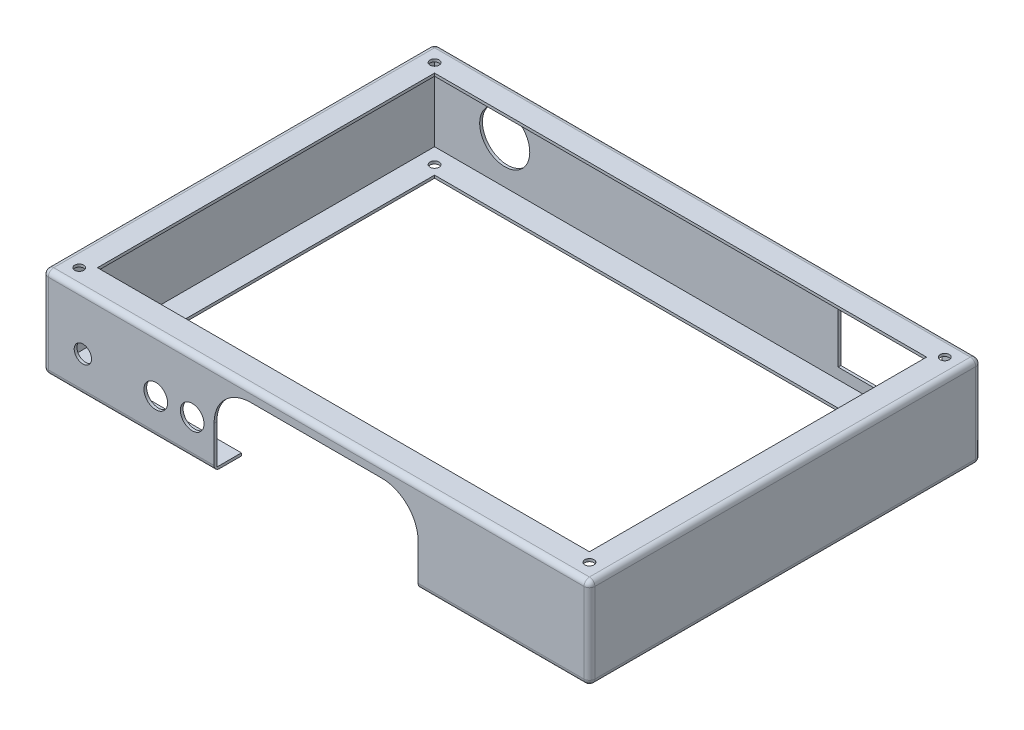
ISO-10303-21;
HEADER;
FILE_DESCRIPTION(('STEP AP214'),'2;1');
FILE_NAME('part.step','',(''),(''),'','','');
FILE_SCHEMA(('AUTOMOTIVE_DESIGN { 1 0 10303 214 1 1 1 1 }'));
ENDSEC;
DATA;
#1=APPLICATION_CONTEXT('core data for automotive mechanical design processes');
#2=APPLICATION_PROTOCOL_DEFINITION('international standard','automotive_design',2000,#1);
#3=PRODUCT_CONTEXT('',#1,'mechanical');
#4=PRODUCT('Part','Part','',(#3));
#5=PRODUCT_RELATED_PRODUCT_CATEGORY('part','',(#4));
#6=PRODUCT_DEFINITION_FORMATION('','',#4);
#7=PRODUCT_DEFINITION_CONTEXT('part definition',#1,'design');
#8=PRODUCT_DEFINITION('design','',#6,#7);
#9=PRODUCT_DEFINITION_SHAPE('','',#8);
#10=(LENGTH_UNIT() NAMED_UNIT(*) SI_UNIT(.MILLI.,.METRE.));
#11=(NAMED_UNIT(*) PLANE_ANGLE_UNIT() SI_UNIT($,.RADIAN.));
#12=(NAMED_UNIT(*) SI_UNIT($,.STERADIAN.) SOLID_ANGLE_UNIT());
#13=UNCERTAINTY_MEASURE_WITH_UNIT(LENGTH_MEASURE(1.E-05),#10,'distance_accuracy_value','');
#14=(GEOMETRIC_REPRESENTATION_CONTEXT(3) GLOBAL_UNCERTAINTY_ASSIGNED_CONTEXT((#13)) GLOBAL_UNIT_ASSIGNED_CONTEXT((#10,
#11,#12)) REPRESENTATION_CONTEXT('',''));
#15=CARTESIAN_POINT('',(0.,0.,0.));
#16=DIRECTION('',(0.,0.,1.));
#17=DIRECTION('',(1.,0.,0.));
#18=AXIS2_PLACEMENT_3D('',#15,#16,#17);
#19=CARTESIAN_POINT('',(0.,3.,-3.));
#20=DIRECTION('',(-1.,0.,0.));
#21=DIRECTION('',(0.,0.,1.));
#22=AXIS2_PLACEMENT_3D('',#19,#20,#21);
#23=CYLINDRICAL_SURFACE('',#22,3.);
#24=CARTESIAN_POINT('',(206.,3.,-3.));
#25=DIRECTION('',(1.,0.,0.));
#26=DIRECTION('',(0.,0.,-1.));
#27=AXIS2_PLACEMENT_3D('',#24,#25,#26);
#28=CIRCLE('',#27,3.);
#29=CARTESIAN_POINT('',(206.,0.,-3.));
#30=VERTEX_POINT('',#29);
#31=CARTESIAN_POINT('',(206.,3.,0.));
#32=VERTEX_POINT('',#31);
#33=EDGE_CURVE('E470',#30,#32,#28,.F.);
#34=ORIENTED_EDGE('',*,*,#33,.F.);
#35=DIRECTION('',(1.,0.,0.));
#36=VECTOR('',#35,1.);
#37=CARTESIAN_POINT('',(0.,0.,-3.));
#38=LINE('',#37,#36);
#39=CARTESIAN_POINT('',(297.,0.,-3.));
#40=VERTEX_POINT('',#39);
#41=EDGE_CURVE('E551',#40,#30,#38,.F.);
#42=ORIENTED_EDGE('',*,*,#41,.F.);
#43=CARTESIAN_POINT('',(297.,3.,-3.));
#44=DIRECTION('',(1.,0.,0.));
#45=DIRECTION('',(0.,0.,-1.));
#46=AXIS2_PLACEMENT_3D('',#43,#44,#45);
#47=CIRCLE('',#46,3.);
#48=CARTESIAN_POINT('',(297.,3.,0.));
#49=VERTEX_POINT('',#48);
#50=EDGE_CURVE('E593',#49,#40,#47,.T.);
#51=ORIENTED_EDGE('',*,*,#50,.F.);
#52=DIRECTION('',(1.,0.,0.));
#53=VECTOR('',#52,1.);
#54=CARTESIAN_POINT('',(300.,3.,0.));
#55=LINE('',#54,#53);
#56=EDGE_CURVE('E540',#32,#49,#55,.T.);
#57=ORIENTED_EDGE('',*,*,#56,.F.);
#58=EDGE_LOOP('',(#34,#42,#51,#57));
#59=FACE_BOUND('',#58,.T.);
#60=ADVANCED_FACE('F33',(#59),#23,.T.);
#61=CARTESIAN_POINT('',(0.,50.,0.));
#62=DIRECTION('',(1.,0.,0.));
#63=DIRECTION('',(0.,0.,-1.));
#64=AXIS2_PLACEMENT_3D('',#61,#62,#63);
#65=PLANE('',#64);
#66=DIRECTION('',(0.,-1.,0.));
#67=VECTOR('',#66,1.);
#68=CARTESIAN_POINT('',(0.,50.,-212.));
#69=LINE('',#68,#67);
#70=CARTESIAN_POINT('',(0.,47.,-212.));
#71=VERTEX_POINT('',#70);
#72=CARTESIAN_POINT('',(0.,3.,-212.));
#73=VERTEX_POINT('',#72);
#74=EDGE_CURVE('E528',#71,#73,#69,.T.);
#75=ORIENTED_EDGE('',*,*,#74,.T.);
#76=DIRECTION('',(0.,0.,1.));
#77=VECTOR('',#76,1.);
#78=CARTESIAN_POINT('',(0.,3.,0.));
#79=LINE('',#78,#77);
#80=CARTESIAN_POINT('',(0.,3.,-3.));
#81=VERTEX_POINT('',#80);
#82=EDGE_CURVE('E531',#73,#81,#79,.T.);
#83=ORIENTED_EDGE('',*,*,#82,.T.);
#84=DIRECTION('',(0.,-1.,0.));
#85=VECTOR('',#84,1.);
#86=CARTESIAN_POINT('',(0.,50.,-3.));
#87=LINE('',#86,#85);
#88=CARTESIAN_POINT('',(0.,47.,-3.));
#89=VERTEX_POINT('',#88);
#90=EDGE_CURVE('E526',#81,#89,#87,.F.);
#91=ORIENTED_EDGE('',*,*,#90,.T.);
#92=DIRECTION('',(0.,0.,1.));
#93=VECTOR('',#92,1.);
#94=CARTESIAN_POINT('',(0.,47.,0.));
#95=LINE('',#94,#93);
#96=EDGE_CURVE('E524',#89,#71,#95,.F.);
#97=ORIENTED_EDGE('',*,*,#96,.T.);
#98=EDGE_LOOP('',(#75,#83,#91,#97));
#99=FACE_BOUND('',#98,.T.);
#100=ADVANCED_FACE('F816',(#99),#65,.F.);
#101=CARTESIAN_POINT('',(0.,50.,0.));
#102=DIRECTION('',(0.,0.,-1.));
#103=DIRECTION('',(-1.,0.,0.));
#104=AXIS2_PLACEMENT_3D('',#101,#102,#103);
#105=PLANE('',#104);
#106=CARTESIAN_POINT('',(62.,20.,0.));
#107=DIRECTION('',(0.,0.,1.));
#108=DIRECTION('',(1.,0.,0.));
#109=AXIS2_PLACEMENT_3D('',#106,#107,#108);
#110=CIRCLE('',#109,6.5);
#111=CARTESIAN_POINT('',(68.5,20.,0.));
#112=VERTEX_POINT('',#111);
#113=EDGE_CURVE('E421',#112,#112,#110,.T.);
#114=ORIENTED_EDGE('',*,*,#113,.F.);
#115=EDGE_LOOP('',(#114));
#116=FACE_BOUND('',#115,.T.);
#117=CARTESIAN_POINT('',(22.,20.,0.));
#118=DIRECTION('',(0.,0.,1.));
#119=DIRECTION('',(1.,0.,0.));
#120=AXIS2_PLACEMENT_3D('',#117,#118,#119);
#121=CIRCLE('',#120,4.75);
#122=CARTESIAN_POINT('',(26.75,20.,0.));
#123=VERTEX_POINT('',#122);
#124=EDGE_CURVE('E425',#123,#123,#121,.T.);
#125=ORIENTED_EDGE('',*,*,#124,.F.);
#126=EDGE_LOOP('',(#125));
#127=FACE_BOUND('',#126,.T.);
#128=CARTESIAN_POINT('',(82.,20.,0.));
#129=DIRECTION('',(0.,0.,1.));
#130=DIRECTION('',(1.,0.,0.));
#131=AXIS2_PLACEMENT_3D('',#128,#129,#130);
#132=CIRCLE('',#131,6.5);
#133=CARTESIAN_POINT('',(88.5,20.,0.));
#134=VERTEX_POINT('',#133);
#135=EDGE_CURVE('E429',#134,#134,#132,.T.);
#136=ORIENTED_EDGE('',*,*,#135,.F.);
#137=EDGE_LOOP('',(#136));
#138=FACE_BOUND('',#137,.T.);
#139=CARTESIAN_POINT('',(186.,23.,0.));
#140=DIRECTION('',(0.,0.,1.));
#141=DIRECTION('',(1.,0.,0.));
#142=AXIS2_PLACEMENT_3D('',#139,#140,#141);
#143=CIRCLE('',#142,20.);
#144=CARTESIAN_POINT('',(206.,23.,0.));
#145=VERTEX_POINT('',#144);
#146=CARTESIAN_POINT('',(186.,43.,0.));
#147=VERTEX_POINT('',#146);
#148=EDGE_CURVE('E442',#145,#147,#143,.T.);
#149=ORIENTED_EDGE('',*,*,#148,.F.);
#150=DIRECTION('',(0.,1.,0.));
#151=VECTOR('',#150,1.);
#152=CARTESIAN_POINT('',(206.,23.,0.));
#153=LINE('',#152,#151);
#154=EDGE_CURVE('E439',#32,#145,#153,.T.);
#155=ORIENTED_EDGE('',*,*,#154,.F.);
#156=ORIENTED_EDGE('',*,*,#56,.T.);
#157=DIRECTION('',(0.,-1.,0.));
#158=VECTOR('',#157,1.);
#159=CARTESIAN_POINT('',(297.,50.,0.));
#160=LINE('',#159,#158);
#161=CARTESIAN_POINT('',(297.,47.,0.));
#162=VERTEX_POINT('',#161);
#163=EDGE_CURVE('E535',#49,#162,#160,.F.);
#164=ORIENTED_EDGE('',*,*,#163,.T.);
#165=DIRECTION('',(1.,0.,0.));
#166=VECTOR('',#165,1.);
#167=CARTESIAN_POINT('',(0.,47.,0.));
#168=LINE('',#167,#166);
#169=CARTESIAN_POINT('',(3.,47.,0.));
#170=VERTEX_POINT('',#169);
#171=EDGE_CURVE('E533',#162,#170,#168,.F.);
#172=ORIENTED_EDGE('',*,*,#171,.T.);
#173=DIRECTION('',(0.,-1.,0.));
#174=VECTOR('',#173,1.);
#175=CARTESIAN_POINT('',(3.,50.,0.));
#176=LINE('',#175,#174);
#177=CARTESIAN_POINT('',(3.,3.,0.));
#178=VERTEX_POINT('',#177);
#179=EDGE_CURVE('E537',#170,#178,#176,.T.);
#180=ORIENTED_EDGE('',*,*,#179,.T.);
#181=CARTESIAN_POINT('',(94.,3.,0.));
#182=VERTEX_POINT('',#181);
#183=EDGE_CURVE('E541',#178,#182,#55,.T.);
#184=ORIENTED_EDGE('',*,*,#183,.T.);
#185=DIRECTION('',(0.,-1.,0.));
#186=VECTOR('',#185,1.);
#187=CARTESIAN_POINT('',(94.,23.,0.));
#188=LINE('',#187,#186);
#189=CARTESIAN_POINT('',(94.,23.,0.));
#190=VERTEX_POINT('',#189);
#191=EDGE_CURVE('E436',#190,#182,#188,.T.);
#192=ORIENTED_EDGE('',*,*,#191,.F.);
#193=CARTESIAN_POINT('',(114.,23.,0.));
#194=DIRECTION('',(0.,0.,1.));
#195=DIRECTION('',(-1.,0.,0.));
#196=AXIS2_PLACEMENT_3D('',#193,#194,#195);
#197=CIRCLE('',#196,20.);
#198=CARTESIAN_POINT('',(114.,43.,0.));
#199=VERTEX_POINT('',#198);
#200=EDGE_CURVE('E448',#199,#190,#197,.T.);
#201=ORIENTED_EDGE('',*,*,#200,.F.);
#202=DIRECTION('',(-1.,0.,0.));
#203=VECTOR('',#202,1.);
#204=CARTESIAN_POINT('',(114.,43.,0.));
#205=LINE('',#204,#203);
#206=EDGE_CURVE('E445',#147,#199,#205,.T.);
#207=ORIENTED_EDGE('',*,*,#206,.F.);
#208=EDGE_LOOP('',(#149,#155,#156,#164,#172,#180,#184,#192,#201,#207));
#209=FACE_BOUND('',#208,.T.);
#210=ADVANCED_FACE('F784',(#116,#127,#138,#209),#105,.F.);
#211=CARTESIAN_POINT('',(300.,50.,0.));
#212=DIRECTION('',(-1.,0.,0.));
#213=DIRECTION('',(0.,0.,1.));
#214=AXIS2_PLACEMENT_3D('',#211,#212,#213);
#215=PLANE('',#214);
#216=DIRECTION('',(0.,-1.,0.));
#217=VECTOR('',#216,1.);
#218=CARTESIAN_POINT('',(300.,50.,-3.));
#219=LINE('',#218,#217);
#220=CARTESIAN_POINT('',(300.,47.,-3.));
#221=VERTEX_POINT('',#220);
#222=CARTESIAN_POINT('',(300.,3.,-3.));
#223=VERTEX_POINT('',#222);
#224=EDGE_CURVE('E517',#221,#223,#219,.T.);
#225=ORIENTED_EDGE('',*,*,#224,.T.);
#226=DIRECTION('',(0.,0.,-1.));
#227=VECTOR('',#226,1.);
#228=CARTESIAN_POINT('',(300.,3.,-215.));
#229=LINE('',#228,#227);
#230=CARTESIAN_POINT('',(300.,3.,-212.));
#231=VERTEX_POINT('',#230);
#232=EDGE_CURVE('E522',#223,#231,#229,.T.);
#233=ORIENTED_EDGE('',*,*,#232,.T.);
#234=DIRECTION('',(0.,-1.,0.));
#235=VECTOR('',#234,1.);
#236=CARTESIAN_POINT('',(300.,50.,-212.));
#237=LINE('',#236,#235);
#238=CARTESIAN_POINT('',(300.,47.,-212.));
#239=VERTEX_POINT('',#238);
#240=EDGE_CURVE('E519',#231,#239,#237,.F.);
#241=ORIENTED_EDGE('',*,*,#240,.T.);
#242=DIRECTION('',(0.,0.,-1.));
#243=VECTOR('',#242,1.);
#244=CARTESIAN_POINT('',(300.,47.,0.));
#245=LINE('',#244,#243);
#246=EDGE_CURVE('E515',#239,#221,#245,.F.);
#247=ORIENTED_EDGE('',*,*,#246,.T.);
#248=EDGE_LOOP('',(#225,#233,#241,#247));
#249=FACE_BOUND('',#248,.T.);
#250=ADVANCED_FACE('F855',(#249),#215,.F.);
#251=CARTESIAN_POINT('',(0.,50.,-215.));
#252=DIRECTION('',(0.,0.,1.));
#253=DIRECTION('',(1.,0.,0.));
#254=AXIS2_PLACEMENT_3D('',#251,#252,#253);
#255=PLANE('',#254);
#256=CARTESIAN_POINT('',(40.,25.,-215.));
#257=DIRECTION('',(0.,0.,-1.));
#258=DIRECTION('',(-1.,0.,0.));
#259=AXIS2_PLACEMENT_3D('',#256,#257,#258);
#260=CIRCLE('',#259,13.75);
#261=CARTESIAN_POINT('',(41.5,38.6679369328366,-215.));
#262=VERTEX_POINT('',#261);
#263=CARTESIAN_POINT('',(38.5,38.6679369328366,-215.));
#264=VERTEX_POINT('',#263);
#265=EDGE_CURVE('E314',#262,#264,#260,.T.);
#266=ORIENTED_EDGE('',*,*,#265,.F.);
#267=DIRECTION('',(0.,-1.,0.));
#268=VECTOR('',#267,1.);
#269=CARTESIAN_POINT('',(41.5,40.,-215.));
#270=LINE('',#269,#268);
#271=CARTESIAN_POINT('',(41.5,40.,-215.));
#272=VERTEX_POINT('',#271);
#273=EDGE_CURVE('E331',#272,#262,#270,.T.);
#274=ORIENTED_EDGE('',*,*,#273,.F.);
#275=DIRECTION('',(1.,0.,0.));
#276=VECTOR('',#275,1.);
#277=CARTESIAN_POINT('',(41.5,40.,-215.));
#278=LINE('',#277,#276);
#279=CARTESIAN_POINT('',(38.5,40.,-215.));
#280=VERTEX_POINT('',#279);
#281=EDGE_CURVE('E329',#280,#272,#278,.T.);
#282=ORIENTED_EDGE('',*,*,#281,.F.);
#283=DIRECTION('',(0.,1.,0.));
#284=VECTOR('',#283,1.);
#285=CARTESIAN_POINT('',(38.5,40.,-215.));
#286=LINE('',#285,#284);
#287=EDGE_CURVE('E51',#264,#280,#286,.T.);
#288=ORIENTED_EDGE('',*,*,#287,.F.);
#289=EDGE_LOOP('',(#266,#274,#282,#288));
#290=FACE_BOUND('',#289,.T.);
#291=DIRECTION('',(0.,1.,0.));
#292=VECTOR('',#291,1.);
#293=CARTESIAN_POINT('',(223.,42.5,-215.));
#294=LINE('',#293,#292);
#295=CARTESIAN_POINT('',(223.,7.5,-215.));
#296=VERTEX_POINT('',#295);
#297=CARTESIAN_POINT('',(223.,42.5,-215.));
#298=VERTEX_POINT('',#297);
#299=EDGE_CURVE('E355',#296,#298,#294,.T.);
#300=ORIENTED_EDGE('',*,*,#299,.F.);
#301=DIRECTION('',(-1.,0.,0.));
#302=VECTOR('',#301,1.);
#303=CARTESIAN_POINT('',(280.,7.5,-215.));
#304=LINE('',#303,#302);
#305=CARTESIAN_POINT('',(280.,7.5,-215.));
#306=VERTEX_POINT('',#305);
#307=EDGE_CURVE('E352',#306,#296,#304,.T.);
#308=ORIENTED_EDGE('',*,*,#307,.F.);
#309=DIRECTION('',(0.,-1.,0.));
#310=VECTOR('',#309,1.);
#311=CARTESIAN_POINT('',(280.,42.5,-215.));
#312=LINE('',#311,#310);
#313=CARTESIAN_POINT('',(280.,42.5,-215.));
#314=VERTEX_POINT('',#313);
#315=EDGE_CURVE('E349',#314,#306,#312,.T.);
#316=ORIENTED_EDGE('',*,*,#315,.F.);
#317=DIRECTION('',(1.,0.,0.));
#318=VECTOR('',#317,1.);
#319=CARTESIAN_POINT('',(280.,42.5,-215.));
#320=LINE('',#319,#318);
#321=EDGE_CURVE('E358',#298,#314,#320,.T.);
#322=ORIENTED_EDGE('',*,*,#321,.F.);
#323=EDGE_LOOP('',(#300,#308,#316,#322));
#324=FACE_BOUND('',#323,.T.);
#325=DIRECTION('',(0.,-1.,0.));
#326=VECTOR('',#325,1.);
#327=CARTESIAN_POINT('',(297.,50.,-215.));
#328=LINE('',#327,#326);
#329=CARTESIAN_POINT('',(297.,47.,-215.));
#330=VERTEX_POINT('',#329);
#331=CARTESIAN_POINT('',(297.,3.,-215.));
#332=VERTEX_POINT('',#331);
#333=EDGE_CURVE('E510',#330,#332,#328,.T.);
#334=ORIENTED_EDGE('',*,*,#333,.T.);
#335=DIRECTION('',(-1.,0.,0.));
#336=VECTOR('',#335,1.);
#337=CARTESIAN_POINT('',(0.,3.,-215.));
#338=LINE('',#337,#336);
#339=CARTESIAN_POINT('',(3.,3.,-215.));
#340=VERTEX_POINT('',#339);
#341=EDGE_CURVE('E513',#332,#340,#338,.T.);
#342=ORIENTED_EDGE('',*,*,#341,.T.);
#343=DIRECTION('',(0.,-1.,0.));
#344=VECTOR('',#343,1.);
#345=CARTESIAN_POINT('',(3.,50.,-215.));
#346=LINE('',#345,#344);
#347=CARTESIAN_POINT('',(3.,47.,-215.));
#348=VERTEX_POINT('',#347);
#349=EDGE_CURVE('E508',#340,#348,#346,.F.);
#350=ORIENTED_EDGE('',*,*,#349,.T.);
#351=DIRECTION('',(-1.,0.,0.));
#352=VECTOR('',#351,1.);
#353=CARTESIAN_POINT('',(0.,47.,-215.));
#354=LINE('',#353,#352);
#355=EDGE_CURVE('E475',#348,#330,#354,.F.);
#356=ORIENTED_EDGE('',*,*,#355,.T.);
#357=EDGE_LOOP('',(#334,#342,#350,#356));
#358=FACE_BOUND('',#357,.T.);
#359=ADVANCED_FACE('F914',(#290,#324,#358),#255,.F.);
#360=CARTESIAN_POINT('',(0.,50.,0.));
#361=DIRECTION('',(0.,-1.,0.));
#362=DIRECTION('',(0.,0.,-1.));
#363=AXIS2_PLACEMENT_3D('',#360,#361,#362);
#364=PLANE('',#363);
#365=CARTESIAN_POINT('',(290.,50.,-10.));
#366=DIRECTION('',(0.,-1.,0.));
#367=DIRECTION('',(0.,0.,-1.));
#368=AXIS2_PLACEMENT_3D('',#365,#366,#367);
#369=CIRCLE('',#368,2.50000000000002);
#370=CARTESIAN_POINT('',(290.,50.,-7.49999999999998));
#371=VERTEX_POINT('',#370);
#372=EDGE_CURVE('E674',#371,#371,#369,.T.);
#373=ORIENTED_EDGE('',*,*,#372,.T.);
#374=EDGE_LOOP('',(#373));
#375=FACE_BOUND('',#374,.T.);
#376=CARTESIAN_POINT('',(10.,50.,-10.));
#377=DIRECTION('',(0.,-1.,0.));
#378=DIRECTION('',(0.,0.,-1.));
#379=AXIS2_PLACEMENT_3D('',#376,#377,#378);
#380=CIRCLE('',#379,2.5);
#381=CARTESIAN_POINT('',(10.,50.,-7.5));
#382=VERTEX_POINT('',#381);
#383=EDGE_CURVE('E671',#382,#382,#380,.T.);
#384=ORIENTED_EDGE('',*,*,#383,.T.);
#385=EDGE_LOOP('',(#384));
#386=FACE_BOUND('',#385,.T.);
#387=CARTESIAN_POINT('',(10.,50.,-205.));
#388=DIRECTION('',(0.,-1.,0.));
#389=DIRECTION('',(0.,0.,-1.));
#390=AXIS2_PLACEMENT_3D('',#387,#388,#389);
#391=CIRCLE('',#390,2.5);
#392=CARTESIAN_POINT('',(10.,50.,-202.5));
#393=VERTEX_POINT('',#392);
#394=EDGE_CURVE('E689',#393,#393,#391,.T.);
#395=ORIENTED_EDGE('',*,*,#394,.T.);
#396=EDGE_LOOP('',(#395));
#397=FACE_BOUND('',#396,.T.);
#398=CARTESIAN_POINT('',(290.,50.,-205.));
#399=DIRECTION('',(0.,-1.,0.));
#400=DIRECTION('',(0.,0.,-1.));
#401=AXIS2_PLACEMENT_3D('',#398,#399,#400);
#402=CIRCLE('',#401,2.50000000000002);
#403=CARTESIAN_POINT('',(290.,50.,-202.5));
#404=VERTEX_POINT('',#403);
#405=EDGE_CURVE('E321',#404,#404,#402,.T.);
#406=ORIENTED_EDGE('',*,*,#405,.T.);
#407=EDGE_LOOP('',(#406));
#408=FACE_BOUND('',#407,.T.);
#409=DIRECTION('',(-1.,0.,0.));
#410=VECTOR('',#409,1.);
#411=CARTESIAN_POINT('',(0.,50.,-15.));
#412=LINE('',#411,#410);
#413=CARTESIAN_POINT('',(285.,50.,-15.));
#414=VERTEX_POINT('',#413);
#415=CARTESIAN_POINT('',(15.,50.,-15.));
#416=VERTEX_POINT('',#415);
#417=EDGE_CURVE('E402',#414,#416,#412,.T.);
#418=ORIENTED_EDGE('',*,*,#417,.T.);
#419=DIRECTION('',(0.,0.,-1.));
#420=VECTOR('',#419,1.);
#421=CARTESIAN_POINT('',(15.,50.,0.));
#422=LINE('',#421,#420);
#423=CARTESIAN_POINT('',(15.,50.,-200.));
#424=VERTEX_POINT('',#423);
#425=EDGE_CURVE('E418',#416,#424,#422,.T.);
#426=ORIENTED_EDGE('',*,*,#425,.T.);
#427=DIRECTION('',(1.,0.,0.));
#428=VECTOR('',#427,1.);
#429=CARTESIAN_POINT('',(0.,50.,-200.));
#430=LINE('',#429,#428);
#431=CARTESIAN_POINT('',(285.,50.,-200.));
#432=VERTEX_POINT('',#431);
#433=EDGE_CURVE('E413',#424,#432,#430,.T.);
#434=ORIENTED_EDGE('',*,*,#433,.T.);
#435=DIRECTION('',(0.,0.,1.));
#436=VECTOR('',#435,1.);
#437=CARTESIAN_POINT('',(285.,50.,0.));
#438=LINE('',#437,#436);
#439=EDGE_CURVE('E408',#432,#414,#438,.T.);
#440=ORIENTED_EDGE('',*,*,#439,.T.);
#441=EDGE_LOOP('',(#418,#426,#434,#440));
#442=FACE_BOUND('',#441,.T.);
#443=DIRECTION('',(0.,0.,-1.));
#444=VECTOR('',#443,1.);
#445=CARTESIAN_POINT('',(297.,50.,0.));
#446=LINE('',#445,#444);
#447=CARTESIAN_POINT('',(297.,50.,-3.));
#448=VERTEX_POINT('',#447);
#449=CARTESIAN_POINT('',(297.,50.,-212.));
#450=VERTEX_POINT('',#449);
#451=EDGE_CURVE('E558',#448,#450,#446,.T.);
#452=ORIENTED_EDGE('',*,*,#451,.T.);
#453=DIRECTION('',(-1.,0.,0.));
#454=VECTOR('',#453,1.);
#455=CARTESIAN_POINT('',(0.,50.,-212.));
#456=LINE('',#455,#454);
#457=CARTESIAN_POINT('',(3.,50.,-212.));
#458=VERTEX_POINT('',#457);
#459=EDGE_CURVE('E560',#450,#458,#456,.T.);
#460=ORIENTED_EDGE('',*,*,#459,.T.);
#461=DIRECTION('',(0.,0.,1.));
#462=VECTOR('',#461,1.);
#463=CARTESIAN_POINT('',(3.,50.,0.));
#464=LINE('',#463,#462);
#465=CARTESIAN_POINT('',(3.,50.,-3.));
#466=VERTEX_POINT('',#465);
#467=EDGE_CURVE('E554',#458,#466,#464,.T.);
#468=ORIENTED_EDGE('',*,*,#467,.T.);
#469=DIRECTION('',(1.,0.,0.));
#470=VECTOR('',#469,1.);
#471=CARTESIAN_POINT('',(0.,50.,-3.));
#472=LINE('',#471,#470);
#473=EDGE_CURVE('E556',#466,#448,#472,.T.);
#474=ORIENTED_EDGE('',*,*,#473,.T.);
#475=EDGE_LOOP('',(#452,#460,#468,#474));
#476=FACE_BOUND('',#475,.T.);
#477=ADVANCED_FACE('F862',(#375,#386,#397,#408,#442,#476),#364,.F.);
#478=CARTESIAN_POINT('',(0.,0.,0.));
#479=DIRECTION('',(0.,-1.,0.));
#480=DIRECTION('',(0.,0.,-1.));
#481=AXIS2_PLACEMENT_3D('',#478,#479,#480);
#482=PLANE('',#481);
#483=CARTESIAN_POINT('',(290.,0.,-10.));
#484=DIRECTION('',(0.,1.,0.));
#485=DIRECTION('',(0.,0.,1.));
#486=AXIS2_PLACEMENT_3D('',#483,#484,#485);
#487=CIRCLE('',#486,2.50000000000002);
#488=CARTESIAN_POINT('',(290.,0.,-7.49999999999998));
#489=VERTEX_POINT('',#488);
#490=EDGE_CURVE('E1457',#489,#489,#487,.T.);
#491=ORIENTED_EDGE('',*,*,#490,.T.);
#492=EDGE_LOOP('',(#491));
#493=FACE_BOUND('',#492,.T.);
#494=CARTESIAN_POINT('',(10.,0.,-10.));
#495=DIRECTION('',(0.,1.,0.));
#496=DIRECTION('',(0.,0.,1.));
#497=AXIS2_PLACEMENT_3D('',#494,#495,#496);
#498=CIRCLE('',#497,2.5);
#499=CARTESIAN_POINT('',(10.,0.,-7.5));
#500=VERTEX_POINT('',#499);
#501=EDGE_CURVE('E667',#500,#500,#498,.T.);
#502=ORIENTED_EDGE('',*,*,#501,.T.);
#503=EDGE_LOOP('',(#502));
#504=FACE_BOUND('',#503,.T.);
#505=CARTESIAN_POINT('',(10.,0.,-205.));
#506=DIRECTION('',(0.,1.,0.));
#507=DIRECTION('',(0.,0.,1.));
#508=AXIS2_PLACEMENT_3D('',#505,#506,#507);
#509=CIRCLE('',#508,2.5);
#510=CARTESIAN_POINT('',(10.,0.,-202.5));
#511=VERTEX_POINT('',#510);
#512=EDGE_CURVE('E663',#511,#511,#509,.T.);
#513=ORIENTED_EDGE('',*,*,#512,.T.);
#514=EDGE_LOOP('',(#513));
#515=FACE_BOUND('',#514,.T.);
#516=CARTESIAN_POINT('',(290.,0.,-205.));
#517=DIRECTION('',(0.,1.,0.));
#518=DIRECTION('',(0.,0.,1.));
#519=AXIS2_PLACEMENT_3D('',#516,#517,#518);
#520=CIRCLE('',#519,2.50000000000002);
#521=CARTESIAN_POINT('',(290.,0.,-202.5));
#522=VERTEX_POINT('',#521);
#523=EDGE_CURVE('E659',#522,#522,#520,.T.);
#524=ORIENTED_EDGE('',*,*,#523,.T.);
#525=EDGE_LOOP('',(#524));
#526=FACE_BOUND('',#525,.T.);
#527=DIRECTION('',(1.,0.,0.));
#528=VECTOR('',#527,1.);
#529=CARTESIAN_POINT('',(15.,0.,-15.));
#530=LINE('',#529,#528);
#531=CARTESIAN_POINT('',(206.,0.,-15.));
#532=VERTEX_POINT('',#531);
#533=CARTESIAN_POINT('',(285.,0.,-15.));
#534=VERTEX_POINT('',#533);
#535=EDGE_CURVE('E375',#532,#534,#530,.T.);
#536=ORIENTED_EDGE('',*,*,#535,.T.);
#537=DIRECTION('',(0.,0.,-1.));
#538=VECTOR('',#537,1.);
#539=CARTESIAN_POINT('',(285.,0.,-200.));
#540=LINE('',#539,#538);
#541=CARTESIAN_POINT('',(285.,0.,-200.));
#542=VERTEX_POINT('',#541);
#543=EDGE_CURVE('E379',#534,#542,#540,.T.);
#544=ORIENTED_EDGE('',*,*,#543,.T.);
#545=DIRECTION('',(-1.,0.,0.));
#546=VECTOR('',#545,1.);
#547=CARTESIAN_POINT('',(15.,0.,-200.));
#548=LINE('',#547,#546);
#549=CARTESIAN_POINT('',(15.,0.,-200.));
#550=VERTEX_POINT('',#549);
#551=EDGE_CURVE('E382',#542,#550,#548,.T.);
#552=ORIENTED_EDGE('',*,*,#551,.T.);
#553=DIRECTION('',(0.,0.,1.));
#554=VECTOR('',#553,1.);
#555=CARTESIAN_POINT('',(15.,0.,-200.));
#556=LINE('',#555,#554);
#557=CARTESIAN_POINT('',(15.,0.,-15.));
#558=VERTEX_POINT('',#557);
#559=EDGE_CURVE('E372',#550,#558,#556,.T.);
#560=ORIENTED_EDGE('',*,*,#559,.T.);
#561=CARTESIAN_POINT('',(94.,0.,-15.));
#562=VERTEX_POINT('',#561);
#563=EDGE_CURVE('E376',#558,#562,#530,.T.);
#564=ORIENTED_EDGE('',*,*,#563,.T.);
#565=DIRECTION('',(0.,0.,1.));
#566=VECTOR('',#565,1.);
#567=CARTESIAN_POINT('',(94.,0.,-15.));
#568=LINE('',#567,#566);
#569=CARTESIAN_POINT('',(94.,0.,-3.));
#570=VERTEX_POINT('',#569);
#571=EDGE_CURVE('E455',#562,#570,#568,.T.);
#572=ORIENTED_EDGE('',*,*,#571,.T.);
#573=CARTESIAN_POINT('',(3.,0.,-3.));
#574=VERTEX_POINT('',#573);
#575=EDGE_CURVE('E550',#570,#574,#38,.F.);
#576=ORIENTED_EDGE('',*,*,#575,.T.);
#577=DIRECTION('',(0.,0.,1.));
#578=VECTOR('',#577,1.);
#579=CARTESIAN_POINT('',(3.,0.,-215.));
#580=LINE('',#579,#578);
#581=CARTESIAN_POINT('',(3.,0.,-212.));
#582=VERTEX_POINT('',#581);
#583=EDGE_CURVE('E544',#574,#582,#580,.F.);
#584=ORIENTED_EDGE('',*,*,#583,.T.);
#585=DIRECTION('',(-1.,0.,0.));
#586=VECTOR('',#585,1.);
#587=CARTESIAN_POINT('',(300.,0.,-212.));
#588=LINE('',#587,#586);
#589=CARTESIAN_POINT('',(297.,0.,-212.));
#590=VERTEX_POINT('',#589);
#591=EDGE_CURVE('E546',#582,#590,#588,.F.);
#592=ORIENTED_EDGE('',*,*,#591,.T.);
#593=DIRECTION('',(0.,0.,-1.));
#594=VECTOR('',#593,1.);
#595=CARTESIAN_POINT('',(297.,0.,0.));
#596=LINE('',#595,#594);
#597=EDGE_CURVE('E548',#590,#40,#596,.F.);
#598=ORIENTED_EDGE('',*,*,#597,.T.);
#599=ORIENTED_EDGE('',*,*,#41,.T.);
#600=DIRECTION('',(0.,0.,1.));
#601=VECTOR('',#600,1.);
#602=CARTESIAN_POINT('',(206.,0.,-15.));
#603=LINE('',#602,#601);
#604=EDGE_CURVE('E452',#532,#30,#603,.T.);
#605=ORIENTED_EDGE('',*,*,#604,.F.);
#606=EDGE_LOOP('',(#536,#544,#552,#560,#564,#572,#576,#584,#592,#598,#599,#605));
#607=FACE_BOUND('',#606,.T.);
#608=ADVANCED_FACE('F763',(#493,#504,#515,#526,#607),#482,.T.);
#609=CARTESIAN_POINT('',(3.,50.,-3.));
#610=DIRECTION('',(0.,-1.,0.));
#611=DIRECTION('',(0.,0.,-1.));
#612=AXIS2_PLACEMENT_3D('',#609,#610,#611);
#613=CYLINDRICAL_SURFACE('',#612,3.);
#614=CARTESIAN_POINT('',(3.,47.,-3.));
#615=DIRECTION('',(0.,1.,0.));
#616=DIRECTION('',(0.,0.,1.));
#617=AXIS2_PLACEMENT_3D('',#614,#615,#616);
#618=CIRCLE('',#617,3.);
#619=EDGE_CURVE('E506',#89,#170,#618,.T.);
#620=ORIENTED_EDGE('',*,*,#619,.F.);
#621=ORIENTED_EDGE('',*,*,#90,.F.);
#622=CARTESIAN_POINT('',(3.,3.,-3.));
#623=DIRECTION('',(0.,-1.,0.));
#624=DIRECTION('',(0.,0.,-1.));
#625=AXIS2_PLACEMENT_3D('',#622,#623,#624);
#626=CIRCLE('',#625,3.);
#627=EDGE_CURVE('E625',#178,#81,#626,.T.);
#628=ORIENTED_EDGE('',*,*,#627,.F.);
#629=ORIENTED_EDGE('',*,*,#179,.F.);
#630=EDGE_LOOP('',(#620,#621,#628,#629));
#631=FACE_BOUND('',#630,.T.);
#632=ADVANCED_FACE('F35',(#631),#613,.T.);
#633=CARTESIAN_POINT('',(3.,47.,-3.));
#634=DIRECTION('',(0.,0.,1.));
#635=DIRECTION('',(1.,0.,0.));
#636=AXIS2_PLACEMENT_3D('',#633,#634,#635);
#637=SPHERICAL_SURFACE('',#636,3.);
#638=CARTESIAN_POINT('',(3.,47.,-3.));
#639=DIRECTION('',(0.,0.,1.));
#640=DIRECTION('',(1.,0.,0.));
#641=AXIS2_PLACEMENT_3D('',#638,#639,#640);
#642=CIRCLE('',#641,3.);
#643=EDGE_CURVE('E619',#89,#466,#642,.F.);
#644=ORIENTED_EDGE('',*,*,#643,.F.);
#645=ORIENTED_EDGE('',*,*,#619,.T.);
#646=CARTESIAN_POINT('',(3.,47.,-3.));
#647=DIRECTION('',(-1.,0.,0.));
#648=DIRECTION('',(0.,0.,1.));
#649=AXIS2_PLACEMENT_3D('',#646,#647,#648);
#650=CIRCLE('',#649,3.);
#651=EDGE_CURVE('E622',#466,#170,#650,.F.);
#652=ORIENTED_EDGE('',*,*,#651,.F.);
#653=EDGE_LOOP('',(#644,#645,#652));
#654=FACE_BOUND('',#653,.T.);
#655=ADVANCED_FACE('F808',(#654),#637,.T.);
#656=CARTESIAN_POINT('',(3.,3.,-3.));
#657=DIRECTION('',(0.,0.,1.));
#658=DIRECTION('',(1.,0.,0.));
#659=AXIS2_PLACEMENT_3D('',#656,#657,#658);
#660=SPHERICAL_SURFACE('',#659,3.);
#661=CARTESIAN_POINT('',(3.,3.,-3.));
#662=DIRECTION('',(-1.,0.,0.));
#663=DIRECTION('',(0.,0.,1.));
#664=AXIS2_PLACEMENT_3D('',#661,#662,#663);
#665=CIRCLE('',#664,3.);
#666=EDGE_CURVE('E613',#178,#574,#665,.F.);
#667=ORIENTED_EDGE('',*,*,#666,.F.);
#668=ORIENTED_EDGE('',*,*,#627,.T.);
#669=CARTESIAN_POINT('',(3.,3.,-3.));
#670=DIRECTION('',(0.,0.,1.));
#671=DIRECTION('',(1.,0.,0.));
#672=AXIS2_PLACEMENT_3D('',#669,#670,#671);
#673=CIRCLE('',#672,3.);
#674=EDGE_CURVE('E616',#574,#81,#673,.F.);
#675=ORIENTED_EDGE('',*,*,#674,.F.);
#676=EDGE_LOOP('',(#667,#668,#675));
#677=FACE_BOUND('',#676,.T.);
#678=ADVANCED_FACE('F833',(#677),#660,.T.);
#679=CARTESIAN_POINT('',(0.,47.,-3.));
#680=DIRECTION('',(1.,0.,0.));
#681=DIRECTION('',(0.,0.,-1.));
#682=AXIS2_PLACEMENT_3D('',#679,#680,#681);
#683=CYLINDRICAL_SURFACE('',#682,3.);
#684=ORIENTED_EDGE('',*,*,#651,.T.);
#685=ORIENTED_EDGE('',*,*,#171,.F.);
#686=CARTESIAN_POINT('',(297.,47.,-3.));
#687=DIRECTION('',(1.,0.,0.));
#688=DIRECTION('',(0.,0.,-1.));
#689=AXIS2_PLACEMENT_3D('',#686,#687,#688);
#690=CIRCLE('',#689,3.);
#691=EDGE_CURVE('E607',#448,#162,#690,.T.);
#692=ORIENTED_EDGE('',*,*,#691,.F.);
#693=ORIENTED_EDGE('',*,*,#473,.F.);
#694=EDGE_LOOP('',(#684,#685,#692,#693));
#695=FACE_BOUND('',#694,.T.);
#696=ADVANCED_FACE('F799',(#695),#683,.T.);
#697=CARTESIAN_POINT('',(3.,47.,0.));
#698=DIRECTION('',(0.,0.,1.));
#699=DIRECTION('',(1.,0.,0.));
#700=AXIS2_PLACEMENT_3D('',#697,#698,#699);
#701=CYLINDRICAL_SURFACE('',#700,3.);
#702=ORIENTED_EDGE('',*,*,#643,.T.);
#703=ORIENTED_EDGE('',*,*,#467,.F.);
#704=CARTESIAN_POINT('',(3.,47.,-212.));
#705=DIRECTION('',(0.,0.,-1.));
#706=DIRECTION('',(-1.,0.,0.));
#707=AXIS2_PLACEMENT_3D('',#704,#705,#706);
#708=CIRCLE('',#707,3.);
#709=EDGE_CURVE('E604',#71,#458,#708,.T.);
#710=ORIENTED_EDGE('',*,*,#709,.F.);
#711=ORIENTED_EDGE('',*,*,#96,.F.);
#712=EDGE_LOOP('',(#702,#703,#710,#711));
#713=FACE_BOUND('',#712,.T.);
#714=ADVANCED_FACE('F813',(#713),#701,.T.);
#715=CARTESIAN_POINT('',(3.,50.,-212.));
#716=DIRECTION('',(0.,-1.,0.));
#717=DIRECTION('',(0.,0.,-1.));
#718=AXIS2_PLACEMENT_3D('',#715,#716,#717);
#719=CYLINDRICAL_SURFACE('',#718,3.);
#720=CARTESIAN_POINT('',(3.,3.,-212.));
#721=DIRECTION('',(0.,-1.,0.));
#722=DIRECTION('',(0.,0.,-1.));
#723=AXIS2_PLACEMENT_3D('',#720,#721,#722);
#724=CIRCLE('',#723,3.);
#725=EDGE_CURVE('E598',#73,#340,#724,.T.);
#726=ORIENTED_EDGE('',*,*,#725,.F.);
#727=ORIENTED_EDGE('',*,*,#74,.F.);
#728=CARTESIAN_POINT('',(3.,47.,-212.));
#729=DIRECTION('',(0.,1.,0.));
#730=DIRECTION('',(0.,0.,1.));
#731=AXIS2_PLACEMENT_3D('',#728,#729,#730);
#732=CIRCLE('',#731,3.);
#733=EDGE_CURVE('E601',#348,#71,#732,.T.);
#734=ORIENTED_EDGE('',*,*,#733,.F.);
#735=ORIENTED_EDGE('',*,*,#349,.F.);
#736=EDGE_LOOP('',(#726,#727,#734,#735));
#737=FACE_BOUND('',#736,.T.);
#738=ADVANCED_FACE('F820',(#737),#719,.T.);
#739=CARTESIAN_POINT('',(3.,3.,0.));
#740=DIRECTION('',(0.,0.,-1.));
#741=DIRECTION('',(-1.,0.,0.));
#742=AXIS2_PLACEMENT_3D('',#739,#740,#741);
#743=CYLINDRICAL_SURFACE('',#742,3.);
#744=ORIENTED_EDGE('',*,*,#674,.T.);
#745=ORIENTED_EDGE('',*,*,#82,.F.);
#746=CARTESIAN_POINT('',(3.,3.,-212.));
#747=DIRECTION('',(0.,0.,-1.));
#748=DIRECTION('',(-1.,0.,0.));
#749=AXIS2_PLACEMENT_3D('',#746,#747,#748);
#750=CIRCLE('',#749,3.);
#751=EDGE_CURVE('E596',#582,#73,#750,.T.);
#752=ORIENTED_EDGE('',*,*,#751,.F.);
#753=ORIENTED_EDGE('',*,*,#583,.F.);
#754=EDGE_LOOP('',(#744,#745,#752,#753));
#755=FACE_BOUND('',#754,.T.);
#756=ADVANCED_FACE('F828',(#755),#743,.T.);
#757=CARTESIAN_POINT('',(94.,3.,-3.));
#758=DIRECTION('',(-1.,0.,0.));
#759=DIRECTION('',(0.,-1.,0.));
#760=AXIS2_PLACEMENT_3D('',#757,#758,#759);
#761=CIRCLE('',#760,3.);
#762=EDGE_CURVE('E466',#182,#570,#761,.F.);
#763=ORIENTED_EDGE('',*,*,#762,.F.);
#764=ORIENTED_EDGE('',*,*,#183,.F.);
#765=ORIENTED_EDGE('',*,*,#666,.T.);
#766=ORIENTED_EDGE('',*,*,#575,.F.);
#767=EDGE_LOOP('',(#763,#764,#765,#766));
#768=FACE_BOUND('',#767,.T.);
#769=ADVANCED_FACE('F835',(#768),#23,.T.);
#770=CARTESIAN_POINT('',(297.,50.,-3.));
#771=DIRECTION('',(0.,-1.,0.));
#772=DIRECTION('',(0.,0.,-1.));
#773=AXIS2_PLACEMENT_3D('',#770,#771,#772);
#774=CYLINDRICAL_SURFACE('',#773,3.);
#775=CARTESIAN_POINT('',(297.,47.,-3.));
#776=DIRECTION('',(0.,1.,0.));
#777=DIRECTION('',(0.,0.,1.));
#778=AXIS2_PLACEMENT_3D('',#775,#776,#777);
#779=CIRCLE('',#778,3.);
#780=EDGE_CURVE('E610',#162,#221,#779,.T.);
#781=ORIENTED_EDGE('',*,*,#780,.F.);
#782=ORIENTED_EDGE('',*,*,#163,.F.);
#783=CARTESIAN_POINT('',(297.,3.,-3.));
#784=DIRECTION('',(0.,-1.,0.));
#785=DIRECTION('',(0.,0.,-1.));
#786=AXIS2_PLACEMENT_3D('',#783,#784,#785);
#787=CIRCLE('',#786,3.);
#788=EDGE_CURVE('E590',#223,#49,#787,.T.);
#789=ORIENTED_EDGE('',*,*,#788,.F.);
#790=ORIENTED_EDGE('',*,*,#224,.F.);
#791=EDGE_LOOP('',(#781,#782,#789,#790));
#792=FACE_BOUND('',#791,.T.);
#793=ADVANCED_FACE('F789',(#792),#774,.T.);
#794=CARTESIAN_POINT('',(297.,47.,-3.));
#795=DIRECTION('',(0.,0.,1.));
#796=DIRECTION('',(1.,0.,0.));
#797=AXIS2_PLACEMENT_3D('',#794,#795,#796);
#798=SPHERICAL_SURFACE('',#797,3.);
#799=ORIENTED_EDGE('',*,*,#691,.T.);
#800=ORIENTED_EDGE('',*,*,#780,.T.);
#801=CARTESIAN_POINT('',(297.,47.,-3.));
#802=DIRECTION('',(0.,0.,1.));
#803=DIRECTION('',(1.,0.,0.));
#804=AXIS2_PLACEMENT_3D('',#801,#802,#803);
#805=CIRCLE('',#804,3.);
#806=EDGE_CURVE('E587',#448,#221,#805,.F.);
#807=ORIENTED_EDGE('',*,*,#806,.F.);
#808=EDGE_LOOP('',(#799,#800,#807));
#809=FACE_BOUND('',#808,.T.);
#810=ADVANCED_FACE('F795',(#809),#798,.T.);
#811=CARTESIAN_POINT('',(3.,47.,-212.));
#812=DIRECTION('',(0.,0.,1.));
#813=DIRECTION('',(1.,0.,0.));
#814=AXIS2_PLACEMENT_3D('',#811,#812,#813);
#815=SPHERICAL_SURFACE('',#814,3.);
#816=ORIENTED_EDGE('',*,*,#733,.T.);
#817=ORIENTED_EDGE('',*,*,#709,.T.);
#818=CARTESIAN_POINT('',(3.,47.,-212.));
#819=DIRECTION('',(-1.,0.,0.));
#820=DIRECTION('',(0.,0.,1.));
#821=AXIS2_PLACEMENT_3D('',#818,#819,#820);
#822=CIRCLE('',#821,3.);
#823=EDGE_CURVE('E585',#348,#458,#822,.F.);
#824=ORIENTED_EDGE('',*,*,#823,.F.);
#825=EDGE_LOOP('',(#816,#817,#824));
#826=FACE_BOUND('',#825,.T.);
#827=ADVANCED_FACE('F868',(#826),#815,.T.);
#828=CARTESIAN_POINT('',(3.,3.,-212.));
#829=DIRECTION('',(0.,0.,1.));
#830=DIRECTION('',(1.,0.,0.));
#831=AXIS2_PLACEMENT_3D('',#828,#829,#830);
#832=SPHERICAL_SURFACE('',#831,3.);
#833=ORIENTED_EDGE('',*,*,#751,.T.);
#834=ORIENTED_EDGE('',*,*,#725,.T.);
#835=CARTESIAN_POINT('',(3.,3.,-212.));
#836=DIRECTION('',(-1.,0.,0.));
#837=DIRECTION('',(0.,0.,1.));
#838=AXIS2_PLACEMENT_3D('',#835,#836,#837);
#839=CIRCLE('',#838,3.);
#840=EDGE_CURVE('E582',#582,#340,#839,.F.);
#841=ORIENTED_EDGE('',*,*,#840,.F.);
#842=EDGE_LOOP('',(#833,#834,#841));
#843=FACE_BOUND('',#842,.T.);
#844=ADVANCED_FACE('F870',(#843),#832,.T.);
#845=CARTESIAN_POINT('',(297.,3.,-3.));
#846=DIRECTION('',(0.,0.,1.));
#847=DIRECTION('',(1.,0.,0.));
#848=AXIS2_PLACEMENT_3D('',#845,#846,#847);
#849=SPHERICAL_SURFACE('',#848,3.);
#850=ORIENTED_EDGE('',*,*,#788,.T.);
#851=ORIENTED_EDGE('',*,*,#50,.T.);
#852=CARTESIAN_POINT('',(297.,3.,-3.));
#853=DIRECTION('',(0.,0.,1.));
#854=DIRECTION('',(1.,0.,0.));
#855=AXIS2_PLACEMENT_3D('',#852,#853,#854);
#856=CIRCLE('',#855,3.);
#857=EDGE_CURVE('E579',#223,#40,#856,.F.);
#858=ORIENTED_EDGE('',*,*,#857,.F.);
#859=EDGE_LOOP('',(#850,#851,#858));
#860=FACE_BOUND('',#859,.T.);
#861=ADVANCED_FACE('F876',(#860),#849,.T.);
#862=CARTESIAN_POINT('',(297.,47.,0.));
#863=DIRECTION('',(0.,0.,-1.));
#864=DIRECTION('',(-1.,0.,0.));
#865=AXIS2_PLACEMENT_3D('',#862,#863,#864);
#866=CYLINDRICAL_SURFACE('',#865,3.);
#867=ORIENTED_EDGE('',*,*,#806,.T.);
#868=ORIENTED_EDGE('',*,*,#246,.F.);
#869=CARTESIAN_POINT('',(297.,47.,-212.));
#870=DIRECTION('',(0.,0.,-1.));
#871=DIRECTION('',(-1.,0.,0.));
#872=AXIS2_PLACEMENT_3D('',#869,#870,#871);
#873=CIRCLE('',#872,3.);
#874=EDGE_CURVE('E576',#450,#239,#873,.T.);
#875=ORIENTED_EDGE('',*,*,#874,.F.);
#876=ORIENTED_EDGE('',*,*,#451,.F.);
#877=EDGE_LOOP('',(#867,#868,#875,#876));
#878=FACE_BOUND('',#877,.T.);
#879=ADVANCED_FACE('F859',(#878),#866,.T.);
#880=CARTESIAN_POINT('',(0.,47.,-212.));
#881=DIRECTION('',(-1.,0.,0.));
#882=DIRECTION('',(0.,0.,1.));
#883=AXIS2_PLACEMENT_3D('',#880,#881,#882);
#884=CYLINDRICAL_SURFACE('',#883,3.);
#885=ORIENTED_EDGE('',*,*,#823,.T.);
#886=ORIENTED_EDGE('',*,*,#459,.F.);
#887=CARTESIAN_POINT('',(297.,47.,-212.));
#888=DIRECTION('',(1.,0.,0.));
#889=DIRECTION('',(0.,0.,-1.));
#890=AXIS2_PLACEMENT_3D('',#887,#888,#889);
#891=CIRCLE('',#890,3.);
#892=EDGE_CURVE('E573',#330,#450,#891,.T.);
#893=ORIENTED_EDGE('',*,*,#892,.F.);
#894=ORIENTED_EDGE('',*,*,#355,.F.);
#895=EDGE_LOOP('',(#885,#886,#893,#894));
#896=FACE_BOUND('',#895,.T.);
#897=ADVANCED_FACE('F865',(#896),#884,.T.);
#898=CARTESIAN_POINT('',(0.,3.,-212.));
#899=DIRECTION('',(1.,0.,0.));
#900=DIRECTION('',(0.,0.,-1.));
#901=AXIS2_PLACEMENT_3D('',#898,#899,#900);
#902=CYLINDRICAL_SURFACE('',#901,3.);
#903=ORIENTED_EDGE('',*,*,#840,.T.);
#904=ORIENTED_EDGE('',*,*,#341,.F.);
#905=CARTESIAN_POINT('',(297.,3.,-212.));
#906=DIRECTION('',(1.,0.,0.));
#907=DIRECTION('',(0.,0.,-1.));
#908=AXIS2_PLACEMENT_3D('',#905,#906,#907);
#909=CIRCLE('',#908,3.);
#910=EDGE_CURVE('E570',#590,#332,#909,.T.);
#911=ORIENTED_EDGE('',*,*,#910,.F.);
#912=ORIENTED_EDGE('',*,*,#591,.F.);
#913=EDGE_LOOP('',(#903,#904,#911,#912));
#914=FACE_BOUND('',#913,.T.);
#915=ADVANCED_FACE('F846',(#914),#902,.T.);
#916=CARTESIAN_POINT('',(297.,3.,0.));
#917=DIRECTION('',(0.,0.,1.));
#918=DIRECTION('',(1.,0.,0.));
#919=AXIS2_PLACEMENT_3D('',#916,#917,#918);
#920=CYLINDRICAL_SURFACE('',#919,3.);
#921=ORIENTED_EDGE('',*,*,#857,.T.);
#922=ORIENTED_EDGE('',*,*,#597,.F.);
#923=CARTESIAN_POINT('',(297.,3.,-212.));
#924=DIRECTION('',(0.,0.,-1.));
#925=DIRECTION('',(-1.,0.,0.));
#926=AXIS2_PLACEMENT_3D('',#923,#924,#925);
#927=CIRCLE('',#926,3.);
#928=EDGE_CURVE('E567',#231,#590,#927,.T.);
#929=ORIENTED_EDGE('',*,*,#928,.F.);
#930=ORIENTED_EDGE('',*,*,#232,.F.);
#931=EDGE_LOOP('',(#921,#922,#929,#930));
#932=FACE_BOUND('',#931,.T.);
#933=ADVANCED_FACE('F842',(#932),#920,.T.);
#934=CARTESIAN_POINT('',(297.,47.,-212.));
#935=DIRECTION('',(0.,0.,1.));
#936=DIRECTION('',(1.,0.,0.));
#937=AXIS2_PLACEMENT_3D('',#934,#935,#936);
#938=SPHERICAL_SURFACE('',#937,3.);
#939=ORIENTED_EDGE('',*,*,#892,.T.);
#940=ORIENTED_EDGE('',*,*,#874,.T.);
#941=CARTESIAN_POINT('',(297.,47.,-212.));
#942=DIRECTION('',(0.,1.,0.));
#943=DIRECTION('',(0.,0.,1.));
#944=AXIS2_PLACEMENT_3D('',#941,#942,#943);
#945=CIRCLE('',#944,3.);
#946=EDGE_CURVE('E565',#330,#239,#945,.F.);
#947=ORIENTED_EDGE('',*,*,#946,.F.);
#948=EDGE_LOOP('',(#939,#940,#947));
#949=FACE_BOUND('',#948,.T.);
#950=ADVANCED_FACE('F945',(#949),#938,.T.);
#951=CARTESIAN_POINT('',(297.,3.,-212.));
#952=DIRECTION('',(0.,0.,1.));
#953=DIRECTION('',(1.,0.,0.));
#954=AXIS2_PLACEMENT_3D('',#951,#952,#953);
#955=SPHERICAL_SURFACE('',#954,3.);
#956=ORIENTED_EDGE('',*,*,#928,.T.);
#957=ORIENTED_EDGE('',*,*,#910,.T.);
#958=CARTESIAN_POINT('',(297.,3.,-212.));
#959=DIRECTION('',(0.,-1.,0.));
#960=DIRECTION('',(0.,0.,-1.));
#961=AXIS2_PLACEMENT_3D('',#958,#959,#960);
#962=CIRCLE('',#961,3.);
#963=EDGE_CURVE('E472',#231,#332,#962,.F.);
#964=ORIENTED_EDGE('',*,*,#963,.F.);
#965=EDGE_LOOP('',(#956,#957,#964));
#966=FACE_BOUND('',#965,.T.);
#967=ADVANCED_FACE('F849',(#966),#955,.T.);
#968=CARTESIAN_POINT('',(297.,50.,-212.));
#969=DIRECTION('',(0.,-1.,0.));
#970=DIRECTION('',(0.,0.,-1.));
#971=AXIS2_PLACEMENT_3D('',#968,#969,#970);
#972=CYLINDRICAL_SURFACE('',#971,3.);
#973=ORIENTED_EDGE('',*,*,#946,.T.);
#974=ORIENTED_EDGE('',*,*,#240,.F.);
#975=ORIENTED_EDGE('',*,*,#963,.T.);
#976=ORIENTED_EDGE('',*,*,#333,.F.);
#977=EDGE_LOOP('',(#973,#974,#975,#976));
#978=FACE_BOUND('',#977,.T.);
#979=ADVANCED_FACE('F852',(#978),#972,.T.);
#980=CARTESIAN_POINT('',(206.,23.,-15.));
#981=DIRECTION('',(1.,0.,0.));
#982=DIRECTION('',(0.,0.,-1.));
#983=AXIS2_PLACEMENT_3D('',#980,#981,#982);
#984=PLANE('',#983);
#985=ORIENTED_EDGE('',*,*,#33,.T.);
#986=ORIENTED_EDGE('',*,*,#154,.T.);
#987=DIRECTION('',(0.,0.,1.));
#988=VECTOR('',#987,1.);
#989=CARTESIAN_POINT('',(206.,23.,-15.));
#990=LINE('',#989,#988);
#991=CARTESIAN_POINT('',(206.,23.,-1.5));
#992=VERTEX_POINT('',#991);
#993=EDGE_CURVE('E438',#992,#145,#990,.T.);
#994=ORIENTED_EDGE('',*,*,#993,.F.);
#995=DIRECTION('',(0.,-1.,0.));
#996=VECTOR('',#995,1.);
#997=CARTESIAN_POINT('',(206.,50.,-1.5));
#998=LINE('',#997,#996);
#999=CARTESIAN_POINT('',(206.,1.5,-1.5));
#1000=VERTEX_POINT('',#999);
#1001=EDGE_CURVE('E468',#992,#1000,#998,.T.);
#1002=ORIENTED_EDGE('',*,*,#1001,.T.);
#1003=DIRECTION('',(0.,0.,1.));
#1004=VECTOR('',#1003,1.);
#1005=CARTESIAN_POINT('',(206.,1.5,0.));
#1006=LINE('',#1005,#1004);
#1007=CARTESIAN_POINT('',(206.,1.5,-15.));
#1008=VERTEX_POINT('',#1007);
#1009=EDGE_CURVE('E632',#1008,#1000,#1006,.T.);
#1010=ORIENTED_EDGE('',*,*,#1009,.F.);
#1011=DIRECTION('',(0.,1.,0.));
#1012=VECTOR('',#1011,1.);
#1013=CARTESIAN_POINT('',(206.,23.,-15.));
#1014=LINE('',#1013,#1012);
#1015=EDGE_CURVE('E433',#532,#1008,#1014,.T.);
#1016=ORIENTED_EDGE('',*,*,#1015,.F.);
#1017=ORIENTED_EDGE('',*,*,#604,.T.);
#1018=EDGE_LOOP('',(#985,#986,#994,#1002,#1010,#1016,#1017));
#1019=FACE_BOUND('',#1018,.T.);
#1020=ADVANCED_FACE('F735',(#1019),#984,.F.);
#1021=CARTESIAN_POINT('',(94.,23.,-15.));
#1022=DIRECTION('',(-1.,0.,0.));
#1023=DIRECTION('',(0.,-1.,0.));
#1024=AXIS2_PLACEMENT_3D('',#1021,#1022,#1023);
#1025=PLANE('',#1024);
#1026=ORIENTED_EDGE('',*,*,#762,.T.);
#1027=ORIENTED_EDGE('',*,*,#571,.F.);
#1028=DIRECTION('',(0.,-1.,0.));
#1029=VECTOR('',#1028,1.);
#1030=CARTESIAN_POINT('',(94.,23.,-15.));
#1031=LINE('',#1030,#1029);
#1032=CARTESIAN_POINT('',(94.,1.5,-15.));
#1033=VERTEX_POINT('',#1032);
#1034=EDGE_CURVE('E435',#1033,#562,#1031,.T.);
#1035=ORIENTED_EDGE('',*,*,#1034,.F.);
#1036=DIRECTION('',(0.,0.,-1.));
#1037=VECTOR('',#1036,1.);
#1038=CARTESIAN_POINT('',(94.,1.5,0.));
#1039=LINE('',#1038,#1037);
#1040=CARTESIAN_POINT('',(94.,1.5,-1.5));
#1041=VERTEX_POINT('',#1040);
#1042=EDGE_CURVE('E563',#1041,#1033,#1039,.T.);
#1043=ORIENTED_EDGE('',*,*,#1042,.F.);
#1044=DIRECTION('',(0.,1.,0.));
#1045=VECTOR('',#1044,1.);
#1046=CARTESIAN_POINT('',(93.9999999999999,50.0000000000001,-1.5));
#1047=LINE('',#1046,#1045);
#1048=CARTESIAN_POINT('',(94.,23.,-1.5));
#1049=VERTEX_POINT('',#1048);
#1050=EDGE_CURVE('E454',#1041,#1049,#1047,.T.);
#1051=ORIENTED_EDGE('',*,*,#1050,.T.);
#1052=DIRECTION('',(0.,0.,1.));
#1053=VECTOR('',#1052,1.);
#1054=CARTESIAN_POINT('',(94.,23.,-15.));
#1055=LINE('',#1054,#1053);
#1056=EDGE_CURVE('E458',#1049,#190,#1055,.T.);
#1057=ORIENTED_EDGE('',*,*,#1056,.T.);
#1058=ORIENTED_EDGE('',*,*,#191,.T.);
#1059=EDGE_LOOP('',(#1026,#1027,#1035,#1043,#1051,#1057,#1058));
#1060=FACE_BOUND('',#1059,.T.);
#1061=ADVANCED_FACE('F754',(#1060),#1025,.F.);
#1062=CARTESIAN_POINT('',(114.,23.,-15.));
#1063=DIRECTION('',(0.,0.,1.));
#1064=DIRECTION('',(1.,0.,0.));
#1065=AXIS2_PLACEMENT_3D('',#1062,#1063,#1064);
#1066=CYLINDRICAL_SURFACE('',#1065,20.);
#1067=CARTESIAN_POINT('',(114.,23.,-1.5));
#1068=DIRECTION('',(0.,0.,-1.));
#1069=DIRECTION('',(-1.,0.,0.));
#1070=AXIS2_PLACEMENT_3D('',#1067,#1068,#1069);
#1071=CIRCLE('',#1070,20.);
#1072=CARTESIAN_POINT('',(114.,43.,-1.5));
#1073=VERTEX_POINT('',#1072);
#1074=EDGE_CURVE('E639',#1049,#1073,#1071,.T.);
#1075=ORIENTED_EDGE('',*,*,#1074,.T.);
#1076=DIRECTION('',(0.,0.,1.));
#1077=VECTOR('',#1076,1.);
#1078=CARTESIAN_POINT('',(114.,43.,-15.));
#1079=LINE('',#1078,#1077);
#1080=EDGE_CURVE('E460',#1073,#199,#1079,.T.);
#1081=ORIENTED_EDGE('',*,*,#1080,.T.);
#1082=ORIENTED_EDGE('',*,*,#200,.T.);
#1083=ORIENTED_EDGE('',*,*,#1056,.F.);
#1084=EDGE_LOOP('',(#1075,#1081,#1082,#1083));
#1085=FACE_BOUND('',#1084,.T.);
#1086=ADVANCED_FACE('F750',(#1085),#1066,.F.);
#1087=CARTESIAN_POINT('',(114.,43.,-15.));
#1088=DIRECTION('',(0.,1.,0.));
#1089=DIRECTION('',(-1.,0.,0.));
#1090=AXIS2_PLACEMENT_3D('',#1087,#1088,#1089);
#1091=PLANE('',#1090);
#1092=DIRECTION('',(1.,0.,0.));
#1093=VECTOR('',#1092,1.);
#1094=CARTESIAN_POINT('',(0.,43.,-1.5));
#1095=LINE('',#1094,#1093);
#1096=CARTESIAN_POINT('',(186.,43.,-1.5));
#1097=VERTEX_POINT('',#1096);
#1098=EDGE_CURVE('E637',#1073,#1097,#1095,.T.);
#1099=ORIENTED_EDGE('',*,*,#1098,.T.);
#1100=DIRECTION('',(0.,0.,1.));
#1101=VECTOR('',#1100,1.);
#1102=CARTESIAN_POINT('',(186.,43.,-15.));
#1103=LINE('',#1102,#1101);
#1104=EDGE_CURVE('E462',#1097,#147,#1103,.T.);
#1105=ORIENTED_EDGE('',*,*,#1104,.T.);
#1106=ORIENTED_EDGE('',*,*,#206,.T.);
#1107=ORIENTED_EDGE('',*,*,#1080,.F.);
#1108=EDGE_LOOP('',(#1099,#1105,#1106,#1107));
#1109=FACE_BOUND('',#1108,.T.);
#1110=ADVANCED_FACE('F747',(#1109),#1091,.F.);
#1111=CARTESIAN_POINT('',(186.,23.,-15.));
#1112=DIRECTION('',(0.,0.,1.));
#1113=DIRECTION('',(1.,0.,0.));
#1114=AXIS2_PLACEMENT_3D('',#1111,#1112,#1113);
#1115=CYLINDRICAL_SURFACE('',#1114,20.);
#1116=CARTESIAN_POINT('',(186.,23.,-1.5));
#1117=DIRECTION('',(0.,0.,-1.));
#1118=DIRECTION('',(-1.,0.,0.));
#1119=AXIS2_PLACEMENT_3D('',#1116,#1117,#1118);
#1120=CIRCLE('',#1119,20.);
#1121=EDGE_CURVE('E635',#1097,#992,#1120,.T.);
#1122=ORIENTED_EDGE('',*,*,#1121,.T.);
#1123=ORIENTED_EDGE('',*,*,#993,.T.);
#1124=ORIENTED_EDGE('',*,*,#148,.T.);
#1125=ORIENTED_EDGE('',*,*,#1104,.F.);
#1126=EDGE_LOOP('',(#1122,#1123,#1124,#1125));
#1127=FACE_BOUND('',#1126,.T.);
#1128=ADVANCED_FACE('F741',(#1127),#1115,.F.);
#1129=CARTESIAN_POINT('',(1.5,50.,0.));
#1130=DIRECTION('',(1.,0.,0.));
#1131=DIRECTION('',(0.,0.,-1.));
#1132=AXIS2_PLACEMENT_3D('',#1129,#1130,#1131);
#1133=PLANE('',#1132);
#1134=DIRECTION('',(0.,0.,1.));
#1135=VECTOR('',#1134,1.);
#1136=CARTESIAN_POINT('',(1.5,1.5,0.));
#1137=LINE('',#1136,#1135);
#1138=CARTESIAN_POINT('',(1.5,1.5,-213.5));
#1139=VERTEX_POINT('',#1138);
#1140=CARTESIAN_POINT('',(1.5,1.5,-1.5));
#1141=VERTEX_POINT('',#1140);
#1142=EDGE_CURVE('E503',#1139,#1141,#1137,.T.);
#1143=ORIENTED_EDGE('',*,*,#1142,.F.);
#1144=DIRECTION('',(0.,-1.,0.));
#1145=VECTOR('',#1144,1.);
#1146=CARTESIAN_POINT('',(1.5,50.,-213.5));
#1147=LINE('',#1146,#1145);
#1148=CARTESIAN_POINT('',(1.5,48.5,-213.5));
#1149=VERTEX_POINT('',#1148);
#1150=EDGE_CURVE('E500',#1149,#1139,#1147,.T.);
#1151=ORIENTED_EDGE('',*,*,#1150,.F.);
#1152=DIRECTION('',(0.,0.,1.));
#1153=VECTOR('',#1152,1.);
#1154=CARTESIAN_POINT('',(1.5,48.5,0.));
#1155=LINE('',#1154,#1153);
#1156=CARTESIAN_POINT('',(1.5,48.5,-1.5));
#1157=VERTEX_POINT('',#1156);
#1158=EDGE_CURVE('E480',#1149,#1157,#1155,.T.);
#1159=ORIENTED_EDGE('',*,*,#1158,.T.);
#1160=DIRECTION('',(0.,-1.,0.));
#1161=VECTOR('',#1160,1.);
#1162=CARTESIAN_POINT('',(1.5,50.,-1.5));
#1163=LINE('',#1162,#1161);
#1164=EDGE_CURVE('E493',#1157,#1141,#1163,.T.);
#1165=ORIENTED_EDGE('',*,*,#1164,.T.);
#1166=EDGE_LOOP('',(#1143,#1151,#1159,#1165));
#1167=FACE_BOUND('',#1166,.T.);
#1168=ADVANCED_FACE('F716',(#1167),#1133,.T.);
#1169=CARTESIAN_POINT('',(0.,50.,-1.5));
#1170=DIRECTION('',(0.,0.,-1.));
#1171=DIRECTION('',(-1.,0.,0.));
#1172=AXIS2_PLACEMENT_3D('',#1169,#1170,#1171);
#1173=PLANE('',#1172);
#1174=CARTESIAN_POINT('',(62.,20.,-1.5));
#1175=DIRECTION('',(0.,0.,-1.));
#1176=DIRECTION('',(-1.,0.,0.));
#1177=AXIS2_PLACEMENT_3D('',#1174,#1175,#1176);
#1178=CIRCLE('',#1177,6.5);
#1179=CARTESIAN_POINT('',(55.5,20.,-1.5));
#1180=VERTEX_POINT('',#1179);
#1181=EDGE_CURVE('E424',#1180,#1180,#1178,.T.);
#1182=ORIENTED_EDGE('',*,*,#1181,.F.);
#1183=EDGE_LOOP('',(#1182));
#1184=FACE_BOUND('',#1183,.T.);
#1185=CARTESIAN_POINT('',(22.,20.,-1.5));
#1186=DIRECTION('',(0.,0.,-1.));
#1187=DIRECTION('',(-1.,0.,0.));
#1188=AXIS2_PLACEMENT_3D('',#1185,#1186,#1187);
#1189=CIRCLE('',#1188,4.75);
#1190=CARTESIAN_POINT('',(17.25,20.,-1.5));
#1191=VERTEX_POINT('',#1190);
#1192=EDGE_CURVE('E428',#1191,#1191,#1189,.T.);
#1193=ORIENTED_EDGE('',*,*,#1192,.F.);
#1194=EDGE_LOOP('',(#1193));
#1195=FACE_BOUND('',#1194,.T.);
#1196=CARTESIAN_POINT('',(82.,20.,-1.5));
#1197=DIRECTION('',(0.,0.,-1.));
#1198=DIRECTION('',(-1.,0.,0.));
#1199=AXIS2_PLACEMENT_3D('',#1196,#1197,#1198);
#1200=CIRCLE('',#1199,6.5);
#1201=CARTESIAN_POINT('',(75.5,20.,-1.5));
#1202=VERTEX_POINT('',#1201);
#1203=EDGE_CURVE('E432',#1202,#1202,#1200,.T.);
#1204=ORIENTED_EDGE('',*,*,#1203,.F.);
#1205=EDGE_LOOP('',(#1204));
#1206=FACE_BOUND('',#1205,.T.);
#1207=ORIENTED_EDGE('',*,*,#1001,.F.);
#1208=ORIENTED_EDGE('',*,*,#1121,.F.);
#1209=ORIENTED_EDGE('',*,*,#1098,.F.);
#1210=ORIENTED_EDGE('',*,*,#1074,.F.);
#1211=ORIENTED_EDGE('',*,*,#1050,.F.);
#1212=DIRECTION('',(1.,0.,0.));
#1213=VECTOR('',#1212,1.);
#1214=CARTESIAN_POINT('',(0.,1.5,-1.5));
#1215=LINE('',#1214,#1213);
#1216=EDGE_CURVE('E496',#1141,#1041,#1215,.T.);
#1217=ORIENTED_EDGE('',*,*,#1216,.F.);
#1218=ORIENTED_EDGE('',*,*,#1164,.F.);
#1219=DIRECTION('',(1.,0.,0.));
#1220=VECTOR('',#1219,1.);
#1221=CARTESIAN_POINT('',(0.,48.5,-1.5));
#1222=LINE('',#1221,#1220);
#1223=CARTESIAN_POINT('',(298.5,48.5,-1.5));
#1224=VERTEX_POINT('',#1223);
#1225=EDGE_CURVE('E478',#1157,#1224,#1222,.T.);
#1226=ORIENTED_EDGE('',*,*,#1225,.T.);
#1227=DIRECTION('',(0.,-1.,0.));
#1228=VECTOR('',#1227,1.);
#1229=CARTESIAN_POINT('',(298.5,50.,-1.5));
#1230=LINE('',#1229,#1228);
#1231=CARTESIAN_POINT('',(298.5,1.5,-1.5));
#1232=VERTEX_POINT('',#1231);
#1233=EDGE_CURVE('E488',#1224,#1232,#1230,.T.);
#1234=ORIENTED_EDGE('',*,*,#1233,.T.);
#1235=EDGE_CURVE('E499',#1000,#1232,#1215,.T.);
#1236=ORIENTED_EDGE('',*,*,#1235,.F.);
#1237=EDGE_LOOP('',(#1207,#1208,#1209,#1210,#1211,#1217,#1218,#1226,#1234,#1236));
#1238=FACE_BOUND('',#1237,.T.);
#1239=ADVANCED_FACE('F719',(#1184,#1195,#1206,#1238),#1173,.T.);
#1240=CARTESIAN_POINT('',(298.5,50.,0.));
#1241=DIRECTION('',(-1.,0.,0.));
#1242=DIRECTION('',(0.,0.,1.));
#1243=AXIS2_PLACEMENT_3D('',#1240,#1241,#1242);
#1244=PLANE('',#1243);
#1245=DIRECTION('',(0.,0.,-1.));
#1246=VECTOR('',#1245,1.);
#1247=CARTESIAN_POINT('',(298.5,1.5,0.));
#1248=LINE('',#1247,#1246);
#1249=CARTESIAN_POINT('',(298.5,1.5,-213.5));
#1250=VERTEX_POINT('',#1249);
#1251=EDGE_CURVE('E491',#1232,#1250,#1248,.T.);
#1252=ORIENTED_EDGE('',*,*,#1251,.F.);
#1253=ORIENTED_EDGE('',*,*,#1233,.F.);
#1254=DIRECTION('',(0.,0.,-1.));
#1255=VECTOR('',#1254,1.);
#1256=CARTESIAN_POINT('',(298.5,48.5,0.));
#1257=LINE('',#1256,#1255);
#1258=CARTESIAN_POINT('',(298.5,48.5,-213.5));
#1259=VERTEX_POINT('',#1258);
#1260=EDGE_CURVE('E476',#1224,#1259,#1257,.T.);
#1261=ORIENTED_EDGE('',*,*,#1260,.T.);
#1262=DIRECTION('',(0.,-1.,0.));
#1263=VECTOR('',#1262,1.);
#1264=CARTESIAN_POINT('',(298.5,50.,-213.5));
#1265=LINE('',#1264,#1263);
#1266=EDGE_CURVE('E483',#1259,#1250,#1265,.T.);
#1267=ORIENTED_EDGE('',*,*,#1266,.T.);
#1268=EDGE_LOOP('',(#1252,#1253,#1261,#1267));
#1269=FACE_BOUND('',#1268,.T.);
#1270=ADVANCED_FACE('F729',(#1269),#1244,.T.);
#1271=CARTESIAN_POINT('',(0.,50.,-213.5));
#1272=DIRECTION('',(0.,0.,1.));
#1273=DIRECTION('',(1.,0.,0.));
#1274=AXIS2_PLACEMENT_3D('',#1271,#1272,#1273);
#1275=PLANE('',#1274);
#1276=DIRECTION('',(0.,-1.,0.));
#1277=VECTOR('',#1276,1.);
#1278=CARTESIAN_POINT('',(41.5,40.,-213.5));
#1279=LINE('',#1278,#1277);
#1280=CARTESIAN_POINT('',(41.5,40.,-213.5));
#1281=VERTEX_POINT('',#1280);
#1282=CARTESIAN_POINT('',(41.5,38.6679369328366,-213.5));
#1283=VERTEX_POINT('',#1282);
#1284=EDGE_CURVE('E320',#1281,#1283,#1279,.T.);
#1285=ORIENTED_EDGE('',*,*,#1284,.T.);
#1286=CARTESIAN_POINT('',(40.,25.,-213.5));
#1287=DIRECTION('',(0.,0.,1.));
#1288=DIRECTION('',(1.,0.,0.));
#1289=AXIS2_PLACEMENT_3D('',#1286,#1287,#1288);
#1290=CIRCLE('',#1289,13.75);
#1291=CARTESIAN_POINT('',(38.5,38.6679369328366,-213.5));
#1292=VERTEX_POINT('',#1291);
#1293=EDGE_CURVE('E308',#1283,#1292,#1290,.F.);
#1294=ORIENTED_EDGE('',*,*,#1293,.T.);
#1295=DIRECTION('',(0.,1.,0.));
#1296=VECTOR('',#1295,1.);
#1297=CARTESIAN_POINT('',(38.5,40.,-213.5));
#1298=LINE('',#1297,#1296);
#1299=CARTESIAN_POINT('',(38.5,40.,-213.5));
#1300=VERTEX_POINT('',#1299);
#1301=EDGE_CURVE('E298',#1292,#1300,#1298,.T.);
#1302=ORIENTED_EDGE('',*,*,#1301,.T.);
#1303=DIRECTION('',(1.,0.,0.));
#1304=VECTOR('',#1303,1.);
#1305=CARTESIAN_POINT('',(41.5,40.,-213.5));
#1306=LINE('',#1305,#1304);
#1307=EDGE_CURVE('E307',#1300,#1281,#1306,.T.);
#1308=ORIENTED_EDGE('',*,*,#1307,.T.);
#1309=EDGE_LOOP('',(#1285,#1294,#1302,#1308));
#1310=FACE_BOUND('',#1309,.T.);
#1311=DIRECTION('',(-1.,0.,0.));
#1312=VECTOR('',#1311,1.);
#1313=CARTESIAN_POINT('',(280.,7.5,-213.5));
#1314=LINE('',#1313,#1312);
#1315=CARTESIAN_POINT('',(280.,7.5,-213.5));
#1316=VERTEX_POINT('',#1315);
#1317=CARTESIAN_POINT('',(223.,7.5,-213.5));
#1318=VERTEX_POINT('',#1317);
#1319=EDGE_CURVE('E364',#1316,#1318,#1314,.T.);
#1320=ORIENTED_EDGE('',*,*,#1319,.T.);
#1321=DIRECTION('',(0.,1.,0.));
#1322=VECTOR('',#1321,1.);
#1323=CARTESIAN_POINT('',(223.,42.5,-213.5));
#1324=LINE('',#1323,#1322);
#1325=CARTESIAN_POINT('',(223.,42.5,-213.5));
#1326=VERTEX_POINT('',#1325);
#1327=EDGE_CURVE('E340',#1318,#1326,#1324,.T.);
#1328=ORIENTED_EDGE('',*,*,#1327,.T.);
#1329=DIRECTION('',(1.,0.,0.));
#1330=VECTOR('',#1329,1.);
#1331=CARTESIAN_POINT('',(280.,42.5,-213.5));
#1332=LINE('',#1331,#1330);
#1333=CARTESIAN_POINT('',(280.,42.5,-213.5));
#1334=VERTEX_POINT('',#1333);
#1335=EDGE_CURVE('E343',#1326,#1334,#1332,.T.);
#1336=ORIENTED_EDGE('',*,*,#1335,.T.);
#1337=DIRECTION('',(0.,-1.,0.));
#1338=VECTOR('',#1337,1.);
#1339=CARTESIAN_POINT('',(280.,42.5,-213.5));
#1340=LINE('',#1339,#1338);
#1341=EDGE_CURVE('E346',#1334,#1316,#1340,.T.);
#1342=ORIENTED_EDGE('',*,*,#1341,.T.);
#1343=EDGE_LOOP('',(#1320,#1328,#1336,#1342));
#1344=FACE_BOUND('',#1343,.T.);
#1345=DIRECTION('',(-1.,0.,0.));
#1346=VECTOR('',#1345,1.);
#1347=CARTESIAN_POINT('',(0.,1.5,-213.5));
#1348=LINE('',#1347,#1346);
#1349=EDGE_CURVE('E486',#1250,#1139,#1348,.T.);
#1350=ORIENTED_EDGE('',*,*,#1349,.F.);
#1351=ORIENTED_EDGE('',*,*,#1266,.F.);
#1352=DIRECTION('',(-1.,0.,0.));
#1353=VECTOR('',#1352,1.);
#1354=CARTESIAN_POINT('',(0.,48.5,-213.5));
#1355=LINE('',#1354,#1353);
#1356=EDGE_CURVE('E473',#1259,#1149,#1355,.T.);
#1357=ORIENTED_EDGE('',*,*,#1356,.T.);
#1358=ORIENTED_EDGE('',*,*,#1150,.T.);
#1359=EDGE_LOOP('',(#1350,#1351,#1357,#1358));
#1360=FACE_BOUND('',#1359,.T.);
#1361=ADVANCED_FACE('F318',(#1310,#1344,#1360),#1275,.T.);
#1362=CARTESIAN_POINT('',(0.,48.5,0.));
#1363=DIRECTION('',(0.,-1.,0.));
#1364=DIRECTION('',(0.,0.,-1.));
#1365=AXIS2_PLACEMENT_3D('',#1362,#1363,#1364);
#1366=PLANE('',#1365);
#1367=CARTESIAN_POINT('',(290.,48.5,-10.));
#1368=DIRECTION('',(0.,-1.,0.));
#1369=DIRECTION('',(0.,0.,-1.));
#1370=AXIS2_PLACEMENT_3D('',#1367,#1368,#1369);
#1371=CIRCLE('',#1370,2.50000000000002);
#1372=CARTESIAN_POINT('',(290.,48.5,-7.49999999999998));
#1373=VERTEX_POINT('',#1372);
#1374=EDGE_CURVE('E679',#1373,#1373,#1371,.T.);
#1375=ORIENTED_EDGE('',*,*,#1374,.F.);
#1376=EDGE_LOOP('',(#1375));
#1377=FACE_BOUND('',#1376,.T.);
#1378=CARTESIAN_POINT('',(10.,48.5,-10.));
#1379=DIRECTION('',(0.,-1.,0.));
#1380=DIRECTION('',(0.,0.,-1.));
#1381=AXIS2_PLACEMENT_3D('',#1378,#1379,#1380);
#1382=CIRCLE('',#1381,2.5);
#1383=CARTESIAN_POINT('',(10.,48.5,-7.5));
#1384=VERTEX_POINT('',#1383);
#1385=EDGE_CURVE('E666',#1384,#1384,#1382,.T.);
#1386=ORIENTED_EDGE('',*,*,#1385,.F.);
#1387=EDGE_LOOP('',(#1386));
#1388=FACE_BOUND('',#1387,.T.);
#1389=CARTESIAN_POINT('',(10.,48.5,-205.));
#1390=DIRECTION('',(0.,-1.,0.));
#1391=DIRECTION('',(0.,0.,-1.));
#1392=AXIS2_PLACEMENT_3D('',#1389,#1390,#1391);
#1393=CIRCLE('',#1392,2.5);
#1394=CARTESIAN_POINT('',(10.,48.5,-202.5));
#1395=VERTEX_POINT('',#1394);
#1396=EDGE_CURVE('E662',#1395,#1395,#1393,.T.);
#1397=ORIENTED_EDGE('',*,*,#1396,.F.);
#1398=EDGE_LOOP('',(#1397));
#1399=FACE_BOUND('',#1398,.T.);
#1400=CARTESIAN_POINT('',(290.,48.5,-205.));
#1401=DIRECTION('',(0.,-1.,0.));
#1402=DIRECTION('',(0.,0.,-1.));
#1403=AXIS2_PLACEMENT_3D('',#1400,#1401,#1402);
#1404=CIRCLE('',#1403,2.50000000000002);
#1405=CARTESIAN_POINT('',(290.,48.5,-202.5));
#1406=VERTEX_POINT('',#1405);
#1407=EDGE_CURVE('E324',#1406,#1406,#1404,.T.);
#1408=ORIENTED_EDGE('',*,*,#1407,.F.);
#1409=EDGE_LOOP('',(#1408));
#1410=FACE_BOUND('',#1409,.T.);
#1411=DIRECTION('',(0.,0.,-1.));
#1412=VECTOR('',#1411,1.);
#1413=CARTESIAN_POINT('',(15.,48.5,0.));
#1414=LINE('',#1413,#1412);
#1415=CARTESIAN_POINT('',(15.,48.5,-15.));
#1416=VERTEX_POINT('',#1415);
#1417=CARTESIAN_POINT('',(15.,48.5,-200.));
#1418=VERTEX_POINT('',#1417);
#1419=EDGE_CURVE('E416',#1416,#1418,#1414,.T.);
#1420=ORIENTED_EDGE('',*,*,#1419,.F.);
#1421=DIRECTION('',(-1.,0.,0.));
#1422=VECTOR('',#1421,1.);
#1423=CARTESIAN_POINT('',(0.,48.5,-15.));
#1424=LINE('',#1423,#1422);
#1425=CARTESIAN_POINT('',(285.,48.5,-15.));
#1426=VERTEX_POINT('',#1425);
#1427=EDGE_CURVE('E389',#1426,#1416,#1424,.T.);
#1428=ORIENTED_EDGE('',*,*,#1427,.F.);
#1429=DIRECTION('',(0.,0.,1.));
#1430=VECTOR('',#1429,1.);
#1431=CARTESIAN_POINT('',(285.,48.5,0.));
#1432=LINE('',#1431,#1430);
#1433=CARTESIAN_POINT('',(285.,48.5,-200.));
#1434=VERTEX_POINT('',#1433);
#1435=EDGE_CURVE('E405',#1434,#1426,#1432,.T.);
#1436=ORIENTED_EDGE('',*,*,#1435,.F.);
#1437=DIRECTION('',(1.,0.,0.));
#1438=VECTOR('',#1437,1.);
#1439=CARTESIAN_POINT('',(0.,48.5,-200.));
#1440=LINE('',#1439,#1438);
#1441=EDGE_CURVE('E411',#1418,#1434,#1440,.T.);
#1442=ORIENTED_EDGE('',*,*,#1441,.F.);
#1443=EDGE_LOOP('',(#1420,#1428,#1436,#1442));
#1444=FACE_BOUND('',#1443,.T.);
#1445=ORIENTED_EDGE('',*,*,#1158,.F.);
#1446=ORIENTED_EDGE('',*,*,#1356,.F.);
#1447=ORIENTED_EDGE('',*,*,#1260,.F.);
#1448=ORIENTED_EDGE('',*,*,#1225,.F.);
#1449=EDGE_LOOP('',(#1445,#1446,#1447,#1448));
#1450=FACE_BOUND('',#1449,.T.);
#1451=ADVANCED_FACE('F699',(#1377,#1388,#1399,#1410,#1444,#1450),#1366,.T.);
#1452=CARTESIAN_POINT('',(0.,1.5,0.));
#1453=DIRECTION('',(0.,-1.,0.));
#1454=DIRECTION('',(0.,0.,-1.));
#1455=AXIS2_PLACEMENT_3D('',#1452,#1453,#1454);
#1456=PLANE('',#1455);
#1457=CARTESIAN_POINT('',(290.,1.5,-10.));
#1458=DIRECTION('',(0.,-1.,0.));
#1459=DIRECTION('',(0.,0.,-1.));
#1460=AXIS2_PLACEMENT_3D('',#1457,#1458,#1459);
#1461=CIRCLE('',#1460,2.50000000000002);
#1462=CARTESIAN_POINT('',(290.,1.5,-7.49999999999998));
#1463=VERTEX_POINT('',#1462);
#1464=EDGE_CURVE('E37',#1463,#1463,#1461,.T.);
#1465=ORIENTED_EDGE('',*,*,#1464,.T.);
#1466=EDGE_LOOP('',(#1465));
#1467=FACE_BOUND('',#1466,.T.);
#1468=CARTESIAN_POINT('',(10.,1.5,-10.));
#1469=DIRECTION('',(0.,-1.,0.));
#1470=DIRECTION('',(0.,0.,-1.));
#1471=AXIS2_PLACEMENT_3D('',#1468,#1469,#1470);
#1472=CIRCLE('',#1471,2.5);
#1473=CARTESIAN_POINT('',(10.,1.5,-7.5));
#1474=VERTEX_POINT('',#1473);
#1475=EDGE_CURVE('E664',#1474,#1474,#1472,.T.);
#1476=ORIENTED_EDGE('',*,*,#1475,.T.);
#1477=EDGE_LOOP('',(#1476));
#1478=FACE_BOUND('',#1477,.T.);
#1479=CARTESIAN_POINT('',(10.,1.5,-205.));
#1480=DIRECTION('',(0.,-1.,0.));
#1481=DIRECTION('',(0.,0.,-1.));
#1482=AXIS2_PLACEMENT_3D('',#1479,#1480,#1481);
#1483=CIRCLE('',#1482,2.5);
#1484=CARTESIAN_POINT('',(10.,1.5,-202.5));
#1485=VERTEX_POINT('',#1484);
#1486=EDGE_CURVE('E660',#1485,#1485,#1483,.T.);
#1487=ORIENTED_EDGE('',*,*,#1486,.T.);
#1488=EDGE_LOOP('',(#1487));
#1489=FACE_BOUND('',#1488,.T.);
#1490=CARTESIAN_POINT('',(290.,1.5,-205.));
#1491=DIRECTION('',(0.,-1.,0.));
#1492=DIRECTION('',(0.,0.,-1.));
#1493=AXIS2_PLACEMENT_3D('',#1490,#1491,#1492);
#1494=CIRCLE('',#1493,2.50000000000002);
#1495=CARTESIAN_POINT('',(290.,1.5,-202.5));
#1496=VERTEX_POINT('',#1495);
#1497=EDGE_CURVE('E656',#1496,#1496,#1494,.T.);
#1498=ORIENTED_EDGE('',*,*,#1497,.T.);
#1499=EDGE_LOOP('',(#1498));
#1500=FACE_BOUND('',#1499,.T.);
#1501=DIRECTION('',(0.,0.,1.));
#1502=VECTOR('',#1501,1.);
#1503=CARTESIAN_POINT('',(285.,1.5,0.));
#1504=LINE('',#1503,#1502);
#1505=CARTESIAN_POINT('',(285.,1.5,-200.));
#1506=VERTEX_POINT('',#1505);
#1507=CARTESIAN_POINT('',(285.,1.5,-15.));
#1508=VERTEX_POINT('',#1507);
#1509=EDGE_CURVE('E42',#1506,#1508,#1504,.T.);
#1510=ORIENTED_EDGE('',*,*,#1509,.T.);
#1511=DIRECTION('',(-1.,0.,0.));
#1512=VECTOR('',#1511,1.);
#1513=CARTESIAN_POINT('',(0.,1.5,-15.));
#1514=LINE('',#1513,#1512);
#1515=EDGE_CURVE('E12',#1508,#1008,#1514,.T.);
#1516=ORIENTED_EDGE('',*,*,#1515,.T.);
#1517=ORIENTED_EDGE('',*,*,#1009,.T.);
#1518=ORIENTED_EDGE('',*,*,#1235,.T.);
#1519=ORIENTED_EDGE('',*,*,#1251,.T.);
#1520=ORIENTED_EDGE('',*,*,#1349,.T.);
#1521=ORIENTED_EDGE('',*,*,#1142,.T.);
#1522=ORIENTED_EDGE('',*,*,#1216,.T.);
#1523=ORIENTED_EDGE('',*,*,#1042,.T.);
#1524=CARTESIAN_POINT('',(15.,1.5,-15.));
#1525=VERTEX_POINT('',#1524);
#1526=EDGE_CURVE('E44',#1033,#1525,#1514,.T.);
#1527=ORIENTED_EDGE('',*,*,#1526,.T.);
#1528=DIRECTION('',(0.,0.,-1.));
#1529=VECTOR('',#1528,1.);
#1530=CARTESIAN_POINT('',(15.,1.5,0.));
#1531=LINE('',#1530,#1529);
#1532=CARTESIAN_POINT('',(15.,1.5,-200.));
#1533=VERTEX_POINT('',#1532);
#1534=EDGE_CURVE('E648',#1525,#1533,#1531,.T.);
#1535=ORIENTED_EDGE('',*,*,#1534,.T.);
#1536=DIRECTION('',(1.,0.,0.));
#1537=VECTOR('',#1536,1.);
#1538=CARTESIAN_POINT('',(0.,1.5,-200.));
#1539=LINE('',#1538,#1537);
#1540=EDGE_CURVE('E651',#1533,#1506,#1539,.T.);
#1541=ORIENTED_EDGE('',*,*,#1540,.T.);
#1542=EDGE_LOOP('',(#1510,#1516,#1517,#1518,#1519,#1520,#1521,#1522,#1523,#1527,#1535,#1541));
#1543=FACE_BOUND('',#1542,.T.);
#1544=ADVANCED_FACE('F702',(#1467,#1478,#1489,#1500,#1543),#1456,.F.);
#1545=CARTESIAN_POINT('',(82.,20.,-15.));
#1546=DIRECTION('',(0.,0.,1.));
#1547=DIRECTION('',(1.,0.,0.));
#1548=AXIS2_PLACEMENT_3D('',#1545,#1546,#1547);
#1549=CYLINDRICAL_SURFACE('',#1548,6.5);
#1550=ORIENTED_EDGE('',*,*,#1203,.T.);
#1551=EDGE_LOOP('',(#1550));
#1552=FACE_BOUND('',#1551,.T.);
#1553=ORIENTED_EDGE('',*,*,#135,.T.);
#1554=EDGE_LOOP('',(#1553));
#1555=FACE_BOUND('',#1554,.T.);
#1556=ADVANCED_FACE('F939',(#1552,#1555),#1549,.F.);
#1557=CARTESIAN_POINT('',(22.,20.,-15.));
#1558=DIRECTION('',(0.,0.,1.));
#1559=DIRECTION('',(1.,0.,0.));
#1560=AXIS2_PLACEMENT_3D('',#1557,#1558,#1559);
#1561=CYLINDRICAL_SURFACE('',#1560,4.75);
#1562=ORIENTED_EDGE('',*,*,#1192,.T.);
#1563=EDGE_LOOP('',(#1562));
#1564=FACE_BOUND('',#1563,.T.);
#1565=ORIENTED_EDGE('',*,*,#124,.T.);
#1566=EDGE_LOOP('',(#1565));
#1567=FACE_BOUND('',#1566,.T.);
#1568=ADVANCED_FACE('F1056',(#1564,#1567),#1561,.F.);
#1569=CARTESIAN_POINT('',(62.,20.,-15.));
#1570=DIRECTION('',(0.,0.,1.));
#1571=DIRECTION('',(1.,0.,0.));
#1572=AXIS2_PLACEMENT_3D('',#1569,#1570,#1571);
#1573=CYLINDRICAL_SURFACE('',#1572,6.5);
#1574=ORIENTED_EDGE('',*,*,#1181,.T.);
#1575=EDGE_LOOP('',(#1574));
#1576=FACE_BOUND('',#1575,.T.);
#1577=ORIENTED_EDGE('',*,*,#113,.T.);
#1578=EDGE_LOOP('',(#1577));
#1579=FACE_BOUND('',#1578,.T.);
#1580=ADVANCED_FACE('F1064',(#1576,#1579),#1573,.F.);
#1581=CARTESIAN_POINT('',(15.,0.,-15.));
#1582=DIRECTION('',(0.,0.,1.));
#1583=DIRECTION('',(1.,0.,0.));
#1584=AXIS2_PLACEMENT_3D('',#1581,#1582,#1583);
#1585=PLANE('',#1584);
#1586=ORIENTED_EDGE('',*,*,#1515,.F.);
#1587=DIRECTION('',(0.,1.,0.));
#1588=VECTOR('',#1587,1.);
#1589=CARTESIAN_POINT('',(285.,0.,-15.));
#1590=LINE('',#1589,#1588);
#1591=EDGE_CURVE('E395',#534,#1508,#1590,.T.);
#1592=ORIENTED_EDGE('',*,*,#1591,.F.);
#1593=ORIENTED_EDGE('',*,*,#535,.F.);
#1594=ORIENTED_EDGE('',*,*,#1015,.T.);
#1595=EDGE_LOOP('',(#1586,#1592,#1593,#1594));
#1596=FACE_BOUND('',#1595,.T.);
#1597=ADVANCED_FACE('F776',(#1596),#1585,.F.);
#1598=CARTESIAN_POINT('',(285.,0.,-200.));
#1599=DIRECTION('',(1.,0.,0.));
#1600=DIRECTION('',(0.,0.,-1.));
#1601=AXIS2_PLACEMENT_3D('',#1598,#1599,#1600);
#1602=PLANE('',#1601);
#1603=DIRECTION('',(0.,1.,0.));
#1604=VECTOR('',#1603,1.);
#1605=CARTESIAN_POINT('',(285.,0.,-200.));
#1606=LINE('',#1605,#1604);
#1607=EDGE_CURVE('E391',#542,#1506,#1606,.T.);
#1608=ORIENTED_EDGE('',*,*,#1607,.F.);
#1609=ORIENTED_EDGE('',*,*,#543,.F.);
#1610=ORIENTED_EDGE('',*,*,#1591,.T.);
#1611=ORIENTED_EDGE('',*,*,#1509,.F.);
#1612=EDGE_LOOP('',(#1608,#1609,#1610,#1611));
#1613=FACE_BOUND('',#1612,.T.);
#1614=ADVANCED_FACE('F774',(#1613),#1602,.F.);
#1615=CARTESIAN_POINT('',(15.,0.,-200.));
#1616=DIRECTION('',(0.,0.,-1.));
#1617=DIRECTION('',(-1.,0.,0.));
#1618=AXIS2_PLACEMENT_3D('',#1615,#1616,#1617);
#1619=PLANE('',#1618);
#1620=DIRECTION('',(0.,1.,0.));
#1621=VECTOR('',#1620,1.);
#1622=CARTESIAN_POINT('',(15.,0.,-200.));
#1623=LINE('',#1622,#1621);
#1624=EDGE_CURVE('E386',#550,#1533,#1623,.T.);
#1625=ORIENTED_EDGE('',*,*,#1624,.F.);
#1626=ORIENTED_EDGE('',*,*,#551,.F.);
#1627=ORIENTED_EDGE('',*,*,#1607,.T.);
#1628=ORIENTED_EDGE('',*,*,#1540,.F.);
#1629=EDGE_LOOP('',(#1625,#1626,#1627,#1628));
#1630=FACE_BOUND('',#1629,.T.);
#1631=ADVANCED_FACE('F771',(#1630),#1619,.F.);
#1632=ORIENTED_EDGE('',*,*,#563,.F.);
#1633=DIRECTION('',(0.,1.,0.));
#1634=VECTOR('',#1633,1.);
#1635=CARTESIAN_POINT('',(15.,0.,-15.));
#1636=LINE('',#1635,#1634);
#1637=EDGE_CURVE('E399',#558,#1525,#1636,.T.);
#1638=ORIENTED_EDGE('',*,*,#1637,.T.);
#1639=ORIENTED_EDGE('',*,*,#1526,.F.);
#1640=ORIENTED_EDGE('',*,*,#1034,.T.);
#1641=EDGE_LOOP('',(#1632,#1638,#1639,#1640));
#1642=FACE_BOUND('',#1641,.T.);
#1643=ADVANCED_FACE('F760',(#1642),#1585,.F.);
#1644=CARTESIAN_POINT('',(15.,0.,-200.));
#1645=DIRECTION('',(-1.,0.,0.));
#1646=DIRECTION('',(0.,0.,1.));
#1647=AXIS2_PLACEMENT_3D('',#1644,#1645,#1646);
#1648=PLANE('',#1647);
#1649=ORIENTED_EDGE('',*,*,#1637,.F.);
#1650=ORIENTED_EDGE('',*,*,#559,.F.);
#1651=ORIENTED_EDGE('',*,*,#1624,.T.);
#1652=ORIENTED_EDGE('',*,*,#1534,.F.);
#1653=EDGE_LOOP('',(#1649,#1650,#1651,#1652));
#1654=FACE_BOUND('',#1653,.T.);
#1655=ADVANCED_FACE('F768',(#1654),#1648,.F.);
#1656=EDGE_CURVE('E385',#1416,#416,#1636,.T.);
#1657=ORIENTED_EDGE('',*,*,#1656,.F.);
#1658=ORIENTED_EDGE('',*,*,#1419,.T.);
#1659=EDGE_CURVE('E390',#1418,#424,#1623,.T.);
#1660=ORIENTED_EDGE('',*,*,#1659,.T.);
#1661=ORIENTED_EDGE('',*,*,#425,.F.);
#1662=EDGE_LOOP('',(#1657,#1658,#1660,#1661));
#1663=FACE_BOUND('',#1662,.T.);
#1664=ADVANCED_FACE('F1103',(#1663),#1648,.F.);
#1665=ORIENTED_EDGE('',*,*,#1659,.F.);
#1666=ORIENTED_EDGE('',*,*,#1441,.T.);
#1667=EDGE_CURVE('E394',#1434,#432,#1606,.T.);
#1668=ORIENTED_EDGE('',*,*,#1667,.T.);
#1669=ORIENTED_EDGE('',*,*,#433,.F.);
#1670=EDGE_LOOP('',(#1665,#1666,#1668,#1669));
#1671=FACE_BOUND('',#1670,.T.);
#1672=ADVANCED_FACE('F1092',(#1671),#1619,.F.);
#1673=ORIENTED_EDGE('',*,*,#1667,.F.);
#1674=ORIENTED_EDGE('',*,*,#1435,.T.);
#1675=EDGE_CURVE('E398',#1426,#414,#1590,.T.);
#1676=ORIENTED_EDGE('',*,*,#1675,.T.);
#1677=ORIENTED_EDGE('',*,*,#439,.F.);
#1678=EDGE_LOOP('',(#1673,#1674,#1676,#1677));
#1679=FACE_BOUND('',#1678,.T.);
#1680=ADVANCED_FACE('F1085',(#1679),#1602,.F.);
#1681=ORIENTED_EDGE('',*,*,#1675,.F.);
#1682=ORIENTED_EDGE('',*,*,#1427,.T.);
#1683=ORIENTED_EDGE('',*,*,#1656,.T.);
#1684=ORIENTED_EDGE('',*,*,#417,.F.);
#1685=EDGE_LOOP('',(#1681,#1682,#1683,#1684));
#1686=FACE_BOUND('',#1685,.T.);
#1687=ADVANCED_FACE('F1078',(#1686),#1585,.F.);
#1688=CARTESIAN_POINT('',(280.,7.5,0.001000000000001));
#1689=DIRECTION('',(0.,-1.,0.));
#1690=DIRECTION('',(0.,0.,-1.));
#1691=AXIS2_PLACEMENT_3D('',#1688,#1689,#1690);
#1692=PLANE('',#1691);
#1693=DIRECTION('',(0.,0.,-1.));
#1694=VECTOR('',#1693,1.);
#1695=CARTESIAN_POINT('',(280.,7.5,0.001000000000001));
#1696=LINE('',#1695,#1694);
#1697=EDGE_CURVE('E360',#1316,#306,#1696,.T.);
#1698=ORIENTED_EDGE('',*,*,#1697,.T.);
#1699=ORIENTED_EDGE('',*,*,#307,.T.);
#1700=DIRECTION('',(0.,0.,-1.));
#1701=VECTOR('',#1700,1.);
#1702=CARTESIAN_POINT('',(223.,7.5,0.001000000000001));
#1703=LINE('',#1702,#1701);
#1704=EDGE_CURVE('E367',#1318,#296,#1703,.T.);
#1705=ORIENTED_EDGE('',*,*,#1704,.F.);
#1706=ORIENTED_EDGE('',*,*,#1319,.F.);
#1707=EDGE_LOOP('',(#1698,#1699,#1705,#1706));
#1708=FACE_BOUND('',#1707,.T.);
#1709=ADVANCED_FACE('F1128',(#1708),#1692,.F.);
#1710=CARTESIAN_POINT('',(223.,42.5,0.001000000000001));
#1711=DIRECTION('',(-1.,0.,0.));
#1712=DIRECTION('',(0.,0.,1.));
#1713=AXIS2_PLACEMENT_3D('',#1710,#1711,#1712);
#1714=PLANE('',#1713);
#1715=ORIENTED_EDGE('',*,*,#1704,.T.);
#1716=ORIENTED_EDGE('',*,*,#299,.T.);
#1717=DIRECTION('',(0.,0.,-1.));
#1718=VECTOR('',#1717,1.);
#1719=CARTESIAN_POINT('',(223.,42.5,0.001000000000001));
#1720=LINE('',#1719,#1718);
#1721=EDGE_CURVE('E365',#1326,#298,#1720,.T.);
#1722=ORIENTED_EDGE('',*,*,#1721,.F.);
#1723=ORIENTED_EDGE('',*,*,#1327,.F.);
#1724=EDGE_LOOP('',(#1715,#1716,#1722,#1723));
#1725=FACE_BOUND('',#1724,.T.);
#1726=ADVANCED_FACE('F1134',(#1725),#1714,.F.);
#1727=CARTESIAN_POINT('',(280.,42.5,0.001000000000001));
#1728=DIRECTION('',(0.,1.,0.));
#1729=DIRECTION('',(-1.,0.,0.));
#1730=AXIS2_PLACEMENT_3D('',#1727,#1728,#1729);
#1731=PLANE('',#1730);
#1732=ORIENTED_EDGE('',*,*,#1721,.T.);
#1733=ORIENTED_EDGE('',*,*,#321,.T.);
#1734=DIRECTION('',(0.,0.,-1.));
#1735=VECTOR('',#1734,1.);
#1736=CARTESIAN_POINT('',(280.,42.5,0.001000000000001));
#1737=LINE('',#1736,#1735);
#1738=EDGE_CURVE('E361',#1334,#314,#1737,.T.);
#1739=ORIENTED_EDGE('',*,*,#1738,.F.);
#1740=ORIENTED_EDGE('',*,*,#1335,.F.);
#1741=EDGE_LOOP('',(#1732,#1733,#1739,#1740));
#1742=FACE_BOUND('',#1741,.T.);
#1743=ADVANCED_FACE('F1142',(#1742),#1731,.F.);
#1744=CARTESIAN_POINT('',(280.,42.5,0.001000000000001));
#1745=DIRECTION('',(1.,0.,0.));
#1746=DIRECTION('',(0.,0.,-1.));
#1747=AXIS2_PLACEMENT_3D('',#1744,#1745,#1746);
#1748=PLANE('',#1747);
#1749=ORIENTED_EDGE('',*,*,#1738,.T.);
#1750=ORIENTED_EDGE('',*,*,#315,.T.);
#1751=ORIENTED_EDGE('',*,*,#1697,.F.);
#1752=ORIENTED_EDGE('',*,*,#1341,.F.);
#1753=EDGE_LOOP('',(#1749,#1750,#1751,#1752));
#1754=FACE_BOUND('',#1753,.T.);
#1755=ADVANCED_FACE('F1150',(#1754),#1748,.F.);
#1756=CARTESIAN_POINT('',(41.5,40.,0.001000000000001));
#1757=DIRECTION('',(1.,0.,0.));
#1758=DIRECTION('',(0.,0.,-1.));
#1759=AXIS2_PLACEMENT_3D('',#1756,#1757,#1758);
#1760=PLANE('',#1759);
#1761=DIRECTION('',(0.,0.,-1.));
#1762=VECTOR('',#1761,1.);
#1763=CARTESIAN_POINT('',(41.5,40.,0.001000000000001));
#1764=LINE('',#1763,#1762);
#1765=EDGE_CURVE('E59',#1281,#272,#1764,.T.);
#1766=ORIENTED_EDGE('',*,*,#1765,.T.);
#1767=ORIENTED_EDGE('',*,*,#273,.T.);
#1768=DIRECTION('',(0.,0.,-1.));
#1769=VECTOR('',#1768,1.);
#1770=CARTESIAN_POINT('',(41.5,38.6679369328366,0.001000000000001));
#1771=LINE('',#1770,#1769);
#1772=EDGE_CURVE('E315',#1283,#262,#1771,.T.);
#1773=ORIENTED_EDGE('',*,*,#1772,.F.);
#1774=ORIENTED_EDGE('',*,*,#1284,.F.);
#1775=EDGE_LOOP('',(#1766,#1767,#1773,#1774));
#1776=FACE_BOUND('',#1775,.T.);
#1777=ADVANCED_FACE('F1158',(#1776),#1760,.F.);
#1778=CARTESIAN_POINT('',(40.,25.,0.001000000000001));
#1779=DIRECTION('',(0.,0.,-1.));
#1780=DIRECTION('',(-1.,0.,0.));
#1781=AXIS2_PLACEMENT_3D('',#1778,#1779,#1780);
#1782=CYLINDRICAL_SURFACE('',#1781,13.75);
#1783=ORIENTED_EDGE('',*,*,#1772,.T.);
#1784=ORIENTED_EDGE('',*,*,#265,.T.);
#1785=DIRECTION('',(0.,0.,-1.));
#1786=VECTOR('',#1785,1.);
#1787=CARTESIAN_POINT('',(38.5,38.6679369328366,0.001000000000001));
#1788=LINE('',#1787,#1786);
#1789=EDGE_CURVE('E301',#1292,#264,#1788,.T.);
#1790=ORIENTED_EDGE('',*,*,#1789,.F.);
#1791=ORIENTED_EDGE('',*,*,#1293,.F.);
#1792=EDGE_LOOP('',(#1783,#1784,#1790,#1791));
#1793=FACE_BOUND('',#1792,.T.);
#1794=ADVANCED_FACE('F311',(#1793),#1782,.F.);
#1795=CARTESIAN_POINT('',(38.5,40.,0.001000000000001));
#1796=DIRECTION('',(-1.,0.,0.));
#1797=DIRECTION('',(0.,-1.,0.));
#1798=AXIS2_PLACEMENT_3D('',#1795,#1796,#1797);
#1799=PLANE('',#1798);
#1800=ORIENTED_EDGE('',*,*,#1789,.T.);
#1801=ORIENTED_EDGE('',*,*,#287,.T.);
#1802=DIRECTION('',(0.,0.,-1.));
#1803=VECTOR('',#1802,1.);
#1804=CARTESIAN_POINT('',(38.5,40.,0.001000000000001));
#1805=LINE('',#1804,#1803);
#1806=EDGE_CURVE('E303',#1300,#280,#1805,.T.);
#1807=ORIENTED_EDGE('',*,*,#1806,.F.);
#1808=ORIENTED_EDGE('',*,*,#1301,.F.);
#1809=EDGE_LOOP('',(#1800,#1801,#1807,#1808));
#1810=FACE_BOUND('',#1809,.T.);
#1811=ADVANCED_FACE('F300',(#1810),#1799,.F.);
#1812=CARTESIAN_POINT('',(41.5,40.,0.001000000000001));
#1813=DIRECTION('',(0.,1.,0.));
#1814=DIRECTION('',(0.,0.,1.));
#1815=AXIS2_PLACEMENT_3D('',#1812,#1813,#1814);
#1816=PLANE('',#1815);
#1817=ORIENTED_EDGE('',*,*,#1806,.T.);
#1818=ORIENTED_EDGE('',*,*,#281,.T.);
#1819=ORIENTED_EDGE('',*,*,#1765,.F.);
#1820=ORIENTED_EDGE('',*,*,#1307,.F.);
#1821=EDGE_LOOP('',(#1817,#1818,#1819,#1820));
#1822=FACE_BOUND('',#1821,.T.);
#1823=ADVANCED_FACE('F1179',(#1822),#1816,.F.);
#1824=CARTESIAN_POINT('',(290.,0.,-205.));
#1825=DIRECTION('',(0.,1.,0.));
#1826=DIRECTION('',(0.,0.,1.));
#1827=AXIS2_PLACEMENT_3D('',#1824,#1825,#1826);
#1828=CYLINDRICAL_SURFACE('',#1827,2.50000000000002);
#1829=CARTESIAN_POINT('',(290.,0.,-202.5));
#1830=CARTESIAN_POINT('',(290.,0.0156249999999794,-202.5));
#1831=CARTESIAN_POINT('',(290.,0.0312499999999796,-202.5));
#1832=CARTESIAN_POINT('',(290.,0.0624999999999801,-202.5));
#1833=CARTESIAN_POINT('',(290.,0.0781249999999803,-202.5));
#1834=CARTESIAN_POINT('',(290.,0.109374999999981,-202.5));
#1835=CARTESIAN_POINT('',(290.,0.124999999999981,-202.5));
#1836=CARTESIAN_POINT('',(290.,0.156249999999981,-202.5));
#1837=CARTESIAN_POINT('',(290.,0.171874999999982,-202.5));
#1838=CARTESIAN_POINT('',(290.,0.203124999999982,-202.5));
#1839=CARTESIAN_POINT('',(290.,0.218749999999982,-202.5));
#1840=CARTESIAN_POINT('',(290.,0.249999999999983,-202.5));
#1841=CARTESIAN_POINT('',(290.,0.265624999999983,-202.5));
#1842=CARTESIAN_POINT('',(290.,0.296874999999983,-202.5));
#1843=CARTESIAN_POINT('',(290.,0.312499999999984,-202.5));
#1844=CARTESIAN_POINT('',(290.,0.343749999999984,-202.5));
#1845=CARTESIAN_POINT('',(290.,0.359374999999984,-202.5));
#1846=CARTESIAN_POINT('',(290.,0.390624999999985,-202.5));
#1847=CARTESIAN_POINT('',(290.,0.406249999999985,-202.5));
#1848=CARTESIAN_POINT('',(290.,0.437499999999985,-202.5));
#1849=CARTESIAN_POINT('',(290.,0.453124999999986,-202.5));
#1850=CARTESIAN_POINT('',(290.,0.484374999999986,-202.5));
#1851=CARTESIAN_POINT('',(290.,0.499999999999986,-202.5));
#1852=CARTESIAN_POINT('',(290.,0.531249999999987,-202.5));
#1853=CARTESIAN_POINT('',(290.,0.546874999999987,-202.5));
#1854=CARTESIAN_POINT('',(290.,0.578124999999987,-202.5));
#1855=CARTESIAN_POINT('',(290.,0.593749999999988,-202.5));
#1856=CARTESIAN_POINT('',(290.,0.624999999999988,-202.5));
#1857=CARTESIAN_POINT('',(290.,0.640624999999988,-202.5));
#1858=CARTESIAN_POINT('',(290.,0.671874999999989,-202.5));
#1859=CARTESIAN_POINT('',(290.,0.687499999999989,-202.5));
#1860=CARTESIAN_POINT('',(290.,0.718749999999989,-202.5));
#1861=CARTESIAN_POINT('',(290.,0.734374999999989,-202.5));
#1862=CARTESIAN_POINT('',(290.,0.76562499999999,-202.5));
#1863=CARTESIAN_POINT('',(290.,0.78124999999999,-202.5));
#1864=CARTESIAN_POINT('',(290.,0.812499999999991,-202.5));
#1865=CARTESIAN_POINT('',(290.,0.828124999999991,-202.5));
#1866=CARTESIAN_POINT('',(290.,0.859374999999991,-202.5));
#1867=CARTESIAN_POINT('',(290.,0.874999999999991,-202.5));
#1868=CARTESIAN_POINT('',(290.,0.906249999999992,-202.5));
#1869=CARTESIAN_POINT('',(290.,0.921874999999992,-202.5));
#1870=CARTESIAN_POINT('',(290.,0.953124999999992,-202.5));
#1871=CARTESIAN_POINT('',(290.,0.968749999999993,-202.5));
#1872=CARTESIAN_POINT('',(290.,0.999999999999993,-202.5));
#1873=CARTESIAN_POINT('',(290.,1.01562499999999,-202.5));
#1874=CARTESIAN_POINT('',(290.,1.04687499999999,-202.5));
#1875=CARTESIAN_POINT('',(290.,1.06249999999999,-202.5));
#1876=CARTESIAN_POINT('',(290.,1.09374999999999,-202.5));
#1877=CARTESIAN_POINT('',(290.,1.10937499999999,-202.5));
#1878=CARTESIAN_POINT('',(290.,1.140625,-202.5));
#1879=CARTESIAN_POINT('',(290.,1.15625,-202.5));
#1880=CARTESIAN_POINT('',(290.,1.1875,-202.5));
#1881=CARTESIAN_POINT('',(290.,1.203125,-202.5));
#1882=CARTESIAN_POINT('',(290.,1.234375,-202.5));
#1883=CARTESIAN_POINT('',(290.,1.25,-202.5));
#1884=CARTESIAN_POINT('',(290.,1.28125,-202.5));
#1885=CARTESIAN_POINT('',(290.,1.296875,-202.5));
#1886=CARTESIAN_POINT('',(290.,1.328125,-202.5));
#1887=CARTESIAN_POINT('',(290.,1.34375,-202.5));
#1888=CARTESIAN_POINT('',(290.,1.375,-202.5));
#1889=CARTESIAN_POINT('',(290.,1.390625,-202.5));
#1890=CARTESIAN_POINT('',(290.,1.421875,-202.5));
#1891=CARTESIAN_POINT('',(290.,1.4375,-202.5));
#1892=CARTESIAN_POINT('',(290.,1.46875,-202.5));
#1893=CARTESIAN_POINT('',(290.,1.484375,-202.5));
#1894=CARTESIAN_POINT('',(290.,1.5,-202.5));
#1895=B_SPLINE_CURVE_WITH_KNOTS('',3,(#1829,#1830,#1831,#1832,#1833,#1834,#1835,#1836,#1837,
#1838,#1839,#1840,#1841,#1842,#1843,#1844,#1845,#1846,#1847,#1848,#1849,#1850,#1851,#1852,#1853,
#1854,#1855,#1856,#1857,#1858,#1859,#1860,#1861,#1862,#1863,#1864,#1865,#1866,#1867,#1868,#1869,
#1870,#1871,#1872,#1873,#1874,#1875,#1876,#1877,#1878,#1879,#1880,#1881,#1882,#1883,#1884,#1885,
#1886,#1887,#1888,#1889,#1890,#1891,#1892,#1893,#1894),.UNSPECIFIED.,.F.,.F.,(4,2,2,2,2,2,2,2,2,
2,2,2,2,2,2,2,2,2,2,2,2,2,2,2,2,2,2,2,2,2,2,2,4),(0.,0.0468750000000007,0.0937500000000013,
0.140625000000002,0.187500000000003,0.234375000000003,0.281250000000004,0.328125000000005,
0.375000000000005,0.421875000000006,0.468750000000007,0.515625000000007,0.562500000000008,
0.609375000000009,0.656250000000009,0.70312500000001,0.750000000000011,0.796875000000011,
0.843750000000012,0.890625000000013,0.937500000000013,0.984375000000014,1.03125000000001,
1.07812500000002,1.12500000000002,1.17187500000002,1.21875000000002,1.26562500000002,
1.31250000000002,1.35937500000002,1.40625000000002,1.45312500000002,1.50000000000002),.UNSPECIFIED.);
#1896=EDGE_CURVE('BSEAM1186',#522,#1496,#1895,.T.);
#1897=ORIENTED_EDGE('',*,*,#523,.F.);
#1898=ORIENTED_EDGE('',*,*,#1497,.F.);
#1899=ORIENTED_EDGE('',*,*,#1896,.T.);
#1900=ORIENTED_EDGE('',*,*,#1896,.F.);
#1901=EDGE_LOOP('',(#1897,#1899,#1898,#1900));
#1902=FACE_BOUND('',#1901,.T.);
#1903=ADVANCED_FACE('F1186',(#1902),#1828,.F.);
#1904=CARTESIAN_POINT('',(290.,48.5,-202.5));
#1905=CARTESIAN_POINT('',(290.,48.515625,-202.5));
#1906=CARTESIAN_POINT('',(290.,48.53125,-202.5));
#1907=CARTESIAN_POINT('',(290.,48.5625,-202.5));
#1908=CARTESIAN_POINT('',(290.,48.578125,-202.5));
#1909=CARTESIAN_POINT('',(290.,48.609375,-202.5));
#1910=CARTESIAN_POINT('',(290.,48.625,-202.5));
#1911=CARTESIAN_POINT('',(290.,48.65625,-202.5));
#1912=CARTESIAN_POINT('',(290.,48.671875,-202.5));
#1913=CARTESIAN_POINT('',(290.,48.703125,-202.5));
#1914=CARTESIAN_POINT('',(290.,48.71875,-202.5));
#1915=CARTESIAN_POINT('',(290.,48.75,-202.5));
#1916=CARTESIAN_POINT('',(290.,48.765625,-202.5));
#1917=CARTESIAN_POINT('',(290.,48.796875,-202.5));
#1918=CARTESIAN_POINT('',(290.,48.8125,-202.5));
#1919=CARTESIAN_POINT('',(290.,48.84375,-202.5));
#1920=CARTESIAN_POINT('',(290.,48.859375,-202.5));
#1921=CARTESIAN_POINT('',(290.,48.890625,-202.5));
#1922=CARTESIAN_POINT('',(290.,48.90625,-202.5));
#1923=CARTESIAN_POINT('',(290.,48.9375,-202.5));
#1924=CARTESIAN_POINT('',(290.,48.953125,-202.5));
#1925=CARTESIAN_POINT('',(290.,48.984375,-202.5));
#1926=CARTESIAN_POINT('',(290.,49.,-202.5));
#1927=CARTESIAN_POINT('',(290.,49.03125,-202.5));
#1928=CARTESIAN_POINT('',(290.,49.046875,-202.5));
#1929=CARTESIAN_POINT('',(290.,49.078125,-202.5));
#1930=CARTESIAN_POINT('',(290.,49.09375,-202.5));
#1931=CARTESIAN_POINT('',(290.,49.125,-202.5));
#1932=CARTESIAN_POINT('',(290.,49.140625,-202.5));
#1933=CARTESIAN_POINT('',(290.,49.171875,-202.5));
#1934=CARTESIAN_POINT('',(290.,49.1875,-202.5));
#1935=CARTESIAN_POINT('',(290.,49.21875,-202.5));
#1936=CARTESIAN_POINT('',(290.,49.234375,-202.5));
#1937=CARTESIAN_POINT('',(290.,49.265625,-202.5));
#1938=CARTESIAN_POINT('',(290.,49.28125,-202.5));
#1939=CARTESIAN_POINT('',(290.,49.3125,-202.5));
#1940=CARTESIAN_POINT('',(290.,49.328125,-202.5));
#1941=CARTESIAN_POINT('',(290.,49.359375,-202.5));
#1942=CARTESIAN_POINT('',(290.,49.375,-202.5));
#1943=CARTESIAN_POINT('',(290.,49.40625,-202.5));
#1944=CARTESIAN_POINT('',(290.,49.421875,-202.5));
#1945=CARTESIAN_POINT('',(290.,49.453125,-202.5));
#1946=CARTESIAN_POINT('',(290.,49.46875,-202.5));
#1947=CARTESIAN_POINT('',(290.,49.5,-202.5));
#1948=CARTESIAN_POINT('',(290.,49.515625,-202.5));
#1949=CARTESIAN_POINT('',(290.,49.546875,-202.5));
#1950=CARTESIAN_POINT('',(290.,49.5625,-202.5));
#1951=CARTESIAN_POINT('',(290.,49.59375,-202.5));
#1952=CARTESIAN_POINT('',(290.,49.609375,-202.5));
#1953=CARTESIAN_POINT('',(290.,49.640625,-202.5));
#1954=CARTESIAN_POINT('',(290.,49.65625,-202.5));
#1955=CARTESIAN_POINT('',(290.,49.6875,-202.5));
#1956=CARTESIAN_POINT('',(290.,49.703125,-202.5));
#1957=CARTESIAN_POINT('',(290.,49.734375,-202.5));
#1958=CARTESIAN_POINT('',(290.,49.75,-202.5));
#1959=CARTESIAN_POINT('',(290.,49.78125,-202.5));
#1960=CARTESIAN_POINT('',(290.,49.796875,-202.5));
#1961=CARTESIAN_POINT('',(290.,49.828125,-202.5));
#1962=CARTESIAN_POINT('',(290.,49.84375,-202.5));
#1963=CARTESIAN_POINT('',(290.,49.875,-202.5));
#1964=CARTESIAN_POINT('',(290.,49.890625,-202.5));
#1965=CARTESIAN_POINT('',(290.,49.921875,-202.5));
#1966=CARTESIAN_POINT('',(290.,49.9375,-202.5));
#1967=CARTESIAN_POINT('',(290.,49.96875,-202.5));
#1968=CARTESIAN_POINT('',(290.,49.984375,-202.5));
#1969=CARTESIAN_POINT('',(290.,50.,-202.5));
#1970=B_SPLINE_CURVE_WITH_KNOTS('',3,(#1904,#1905,#1906,#1907,#1908,#1909,#1910,#1911,#1912,
#1913,#1914,#1915,#1916,#1917,#1918,#1919,#1920,#1921,#1922,#1923,#1924,#1925,#1926,#1927,#1928,
#1929,#1930,#1931,#1932,#1933,#1934,#1935,#1936,#1937,#1938,#1939,#1940,#1941,#1942,#1943,#1944,
#1945,#1946,#1947,#1948,#1949,#1950,#1951,#1952,#1953,#1954,#1955,#1956,#1957,#1958,#1959,#1960,
#1961,#1962,#1963,#1964,#1965,#1966,#1967,#1968,#1969),.UNSPECIFIED.,.F.,.F.,(4,2,2,2,2,2,2,2,2,
2,2,2,2,2,2,2,2,2,2,2,2,2,2,2,2,2,2,2,2,2,2,2,4),(0.,0.0468750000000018,0.0937500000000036,
0.140624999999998,0.1875,0.234375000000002,0.281249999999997,0.328124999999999,0.375,
0.421875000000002,0.468750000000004,0.515624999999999,0.5625,0.609375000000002,
0.656249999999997,0.703124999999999,0.750000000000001,0.796875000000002,0.843750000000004,
0.890624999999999,0.937500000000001,0.984375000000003,1.03125,1.078125,1.125,1.171875,1.21875,
1.265625,1.3125,1.359375,1.40625,1.453125,1.5),.UNSPECIFIED.);
#1971=EDGE_CURVE('BSEAM696',#1406,#404,#1970,.T.);
#1972=ORIENTED_EDGE('',*,*,#1407,.T.);
#1973=ORIENTED_EDGE('',*,*,#405,.F.);
#1974=ORIENTED_EDGE('',*,*,#1971,.T.);
#1975=ORIENTED_EDGE('',*,*,#1971,.F.);
#1976=EDGE_LOOP('',(#1972,#1974,#1973,#1975));
#1977=FACE_BOUND('',#1976,.T.);
#1978=ADVANCED_FACE('F696',(#1977),#1828,.F.);
#1979=CARTESIAN_POINT('',(10.,0.,-205.));
#1980=DIRECTION('',(0.,1.,0.));
#1981=DIRECTION('',(0.,0.,1.));
#1982=AXIS2_PLACEMENT_3D('',#1979,#1980,#1981);
#1983=CYLINDRICAL_SURFACE('',#1982,2.5);
#1984=CARTESIAN_POINT('',(10.,0.,-202.5));
#1985=CARTESIAN_POINT('',(10.,0.0156249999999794,-202.5));
#1986=CARTESIAN_POINT('',(10.,0.0312499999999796,-202.5));
#1987=CARTESIAN_POINT('',(10.,0.0624999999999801,-202.5));
#1988=CARTESIAN_POINT('',(10.,0.0781249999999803,-202.5));
#1989=CARTESIAN_POINT('',(10.,0.109374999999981,-202.5));
#1990=CARTESIAN_POINT('',(10.,0.124999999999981,-202.5));
#1991=CARTESIAN_POINT('',(10.,0.156249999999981,-202.5));
#1992=CARTESIAN_POINT('',(10.,0.171874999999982,-202.5));
#1993=CARTESIAN_POINT('',(10.,0.203124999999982,-202.5));
#1994=CARTESIAN_POINT('',(10.,0.218749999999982,-202.5));
#1995=CARTESIAN_POINT('',(10.,0.249999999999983,-202.5));
#1996=CARTESIAN_POINT('',(10.,0.265624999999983,-202.5));
#1997=CARTESIAN_POINT('',(10.,0.296874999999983,-202.5));
#1998=CARTESIAN_POINT('',(10.,0.312499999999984,-202.5));
#1999=CARTESIAN_POINT('',(10.,0.343749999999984,-202.5));
#2000=CARTESIAN_POINT('',(10.,0.359374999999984,-202.5));
#2001=CARTESIAN_POINT('',(10.,0.390624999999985,-202.5));
#2002=CARTESIAN_POINT('',(10.,0.406249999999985,-202.5));
#2003=CARTESIAN_POINT('',(10.,0.437499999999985,-202.5));
#2004=CARTESIAN_POINT('',(10.,0.453124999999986,-202.5));
#2005=CARTESIAN_POINT('',(10.,0.484374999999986,-202.5));
#2006=CARTESIAN_POINT('',(10.,0.499999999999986,-202.5));
#2007=CARTESIAN_POINT('',(10.,0.531249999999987,-202.5));
#2008=CARTESIAN_POINT('',(10.,0.546874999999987,-202.5));
#2009=CARTESIAN_POINT('',(10.,0.578124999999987,-202.5));
#2010=CARTESIAN_POINT('',(10.,0.593749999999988,-202.5));
#2011=CARTESIAN_POINT('',(10.,0.624999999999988,-202.5));
#2012=CARTESIAN_POINT('',(10.,0.640624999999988,-202.5));
#2013=CARTESIAN_POINT('',(10.,0.671874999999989,-202.5));
#2014=CARTESIAN_POINT('',(10.,0.687499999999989,-202.5));
#2015=CARTESIAN_POINT('',(10.,0.718749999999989,-202.5));
#2016=CARTESIAN_POINT('',(10.,0.734374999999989,-202.5));
#2017=CARTESIAN_POINT('',(10.,0.76562499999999,-202.5));
#2018=CARTESIAN_POINT('',(10.,0.78124999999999,-202.5));
#2019=CARTESIAN_POINT('',(10.,0.812499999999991,-202.5));
#2020=CARTESIAN_POINT('',(10.,0.828124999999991,-202.5));
#2021=CARTESIAN_POINT('',(10.,0.859374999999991,-202.5));
#2022=CARTESIAN_POINT('',(10.,0.874999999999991,-202.5));
#2023=CARTESIAN_POINT('',(10.,0.906249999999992,-202.5));
#2024=CARTESIAN_POINT('',(10.,0.921874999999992,-202.5));
#2025=CARTESIAN_POINT('',(10.,0.953124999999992,-202.5));
#2026=CARTESIAN_POINT('',(10.,0.968749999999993,-202.5));
#2027=CARTESIAN_POINT('',(10.,0.999999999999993,-202.5));
#2028=CARTESIAN_POINT('',(10.,1.01562499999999,-202.5));
#2029=CARTESIAN_POINT('',(10.,1.04687499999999,-202.5));
#2030=CARTESIAN_POINT('',(10.,1.06249999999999,-202.5));
#2031=CARTESIAN_POINT('',(10.,1.09374999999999,-202.5));
#2032=CARTESIAN_POINT('',(10.,1.10937499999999,-202.5));
#2033=CARTESIAN_POINT('',(10.,1.140625,-202.5));
#2034=CARTESIAN_POINT('',(10.,1.15625,-202.5));
#2035=CARTESIAN_POINT('',(10.,1.1875,-202.5));
#2036=CARTESIAN_POINT('',(10.,1.203125,-202.5));
#2037=CARTESIAN_POINT('',(10.,1.234375,-202.5));
#2038=CARTESIAN_POINT('',(10.,1.25,-202.5));
#2039=CARTESIAN_POINT('',(10.,1.28125,-202.5));
#2040=CARTESIAN_POINT('',(10.,1.296875,-202.5));
#2041=CARTESIAN_POINT('',(10.,1.328125,-202.5));
#2042=CARTESIAN_POINT('',(10.,1.34375,-202.5));
#2043=CARTESIAN_POINT('',(10.,1.375,-202.5));
#2044=CARTESIAN_POINT('',(10.,1.390625,-202.5));
#2045=CARTESIAN_POINT('',(10.,1.421875,-202.5));
#2046=CARTESIAN_POINT('',(10.,1.4375,-202.5));
#2047=CARTESIAN_POINT('',(10.,1.46875,-202.5));
#2048=CARTESIAN_POINT('',(10.,1.484375,-202.5));
#2049=CARTESIAN_POINT('',(10.,1.5,-202.5));
#2050=B_SPLINE_CURVE_WITH_KNOTS('',3,(#1984,#1985,#1986,#1987,#1988,#1989,#1990,#1991,#1992,
#1993,#1994,#1995,#1996,#1997,#1998,#1999,#2000,#2001,#2002,#2003,#2004,#2005,#2006,#2007,#2008,
#2009,#2010,#2011,#2012,#2013,#2014,#2015,#2016,#2017,#2018,#2019,#2020,#2021,#2022,#2023,#2024,
#2025,#2026,#2027,#2028,#2029,#2030,#2031,#2032,#2033,#2034,#2035,#2036,#2037,#2038,#2039,#2040,
#2041,#2042,#2043,#2044,#2045,#2046,#2047,#2048,#2049),.UNSPECIFIED.,.F.,.F.,(4,2,2,2,2,2,2,2,2,
2,2,2,2,2,2,2,2,2,2,2,2,2,2,2,2,2,2,2,2,2,2,2,4),(0.,0.0468750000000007,0.0937500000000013,
0.140625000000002,0.187500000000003,0.234375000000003,0.281250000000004,0.328125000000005,
0.375000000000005,0.421875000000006,0.468750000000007,0.515625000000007,0.562500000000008,
0.609375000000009,0.656250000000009,0.70312500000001,0.750000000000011,0.796875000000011,
0.843750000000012,0.890625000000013,0.937500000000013,0.984375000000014,1.03125000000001,
1.07812500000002,1.12500000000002,1.17187500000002,1.21875000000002,1.26562500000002,
1.31250000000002,1.35937500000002,1.40625000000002,1.45312500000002,1.50000000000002),.UNSPECIFIED.);
#2051=EDGE_CURVE('BSEAM1200',#511,#1485,#2050,.T.);
#2052=ORIENTED_EDGE('',*,*,#512,.F.);
#2053=ORIENTED_EDGE('',*,*,#1486,.F.);
#2054=ORIENTED_EDGE('',*,*,#2051,.T.);
#2055=ORIENTED_EDGE('',*,*,#2051,.F.);
#2056=EDGE_LOOP('',(#2052,#2054,#2053,#2055));
#2057=FACE_BOUND('',#2056,.T.);
#2058=ADVANCED_FACE('F1200',(#2057),#1983,.F.);
#2059=CARTESIAN_POINT('',(10.,48.5,-202.5));
#2060=CARTESIAN_POINT('',(10.,48.515625,-202.5));
#2061=CARTESIAN_POINT('',(10.,48.53125,-202.5));
#2062=CARTESIAN_POINT('',(10.,48.5625,-202.5));
#2063=CARTESIAN_POINT('',(10.,48.578125,-202.5));
#2064=CARTESIAN_POINT('',(10.,48.609375,-202.5));
#2065=CARTESIAN_POINT('',(10.,48.625,-202.5));
#2066=CARTESIAN_POINT('',(10.,48.65625,-202.5));
#2067=CARTESIAN_POINT('',(10.,48.671875,-202.5));
#2068=CARTESIAN_POINT('',(10.,48.703125,-202.5));
#2069=CARTESIAN_POINT('',(10.,48.71875,-202.5));
#2070=CARTESIAN_POINT('',(10.,48.75,-202.5));
#2071=CARTESIAN_POINT('',(10.,48.765625,-202.5));
#2072=CARTESIAN_POINT('',(10.,48.796875,-202.5));
#2073=CARTESIAN_POINT('',(10.,48.8125,-202.5));
#2074=CARTESIAN_POINT('',(10.,48.84375,-202.5));
#2075=CARTESIAN_POINT('',(10.,48.859375,-202.5));
#2076=CARTESIAN_POINT('',(10.,48.890625,-202.5));
#2077=CARTESIAN_POINT('',(10.,48.90625,-202.5));
#2078=CARTESIAN_POINT('',(10.,48.9375,-202.5));
#2079=CARTESIAN_POINT('',(10.,48.953125,-202.5));
#2080=CARTESIAN_POINT('',(10.,48.984375,-202.5));
#2081=CARTESIAN_POINT('',(10.,49.,-202.5));
#2082=CARTESIAN_POINT('',(10.,49.03125,-202.5));
#2083=CARTESIAN_POINT('',(10.,49.046875,-202.5));
#2084=CARTESIAN_POINT('',(10.,49.078125,-202.5));
#2085=CARTESIAN_POINT('',(10.,49.09375,-202.5));
#2086=CARTESIAN_POINT('',(10.,49.125,-202.5));
#2087=CARTESIAN_POINT('',(10.,49.140625,-202.5));
#2088=CARTESIAN_POINT('',(10.,49.171875,-202.5));
#2089=CARTESIAN_POINT('',(10.,49.1875,-202.5));
#2090=CARTESIAN_POINT('',(10.,49.21875,-202.5));
#2091=CARTESIAN_POINT('',(10.,49.234375,-202.5));
#2092=CARTESIAN_POINT('',(10.,49.265625,-202.5));
#2093=CARTESIAN_POINT('',(10.,49.28125,-202.5));
#2094=CARTESIAN_POINT('',(10.,49.3125,-202.5));
#2095=CARTESIAN_POINT('',(10.,49.328125,-202.5));
#2096=CARTESIAN_POINT('',(10.,49.359375,-202.5));
#2097=CARTESIAN_POINT('',(10.,49.375,-202.5));
#2098=CARTESIAN_POINT('',(10.,49.40625,-202.5));
#2099=CARTESIAN_POINT('',(10.,49.421875,-202.5));
#2100=CARTESIAN_POINT('',(10.,49.453125,-202.5));
#2101=CARTESIAN_POINT('',(10.,49.46875,-202.5));
#2102=CARTESIAN_POINT('',(10.,49.5,-202.5));
#2103=CARTESIAN_POINT('',(10.,49.515625,-202.5));
#2104=CARTESIAN_POINT('',(10.,49.546875,-202.5));
#2105=CARTESIAN_POINT('',(10.,49.5625,-202.5));
#2106=CARTESIAN_POINT('',(10.,49.59375,-202.5));
#2107=CARTESIAN_POINT('',(10.,49.609375,-202.5));
#2108=CARTESIAN_POINT('',(10.,49.640625,-202.5));
#2109=CARTESIAN_POINT('',(10.,49.65625,-202.5));
#2110=CARTESIAN_POINT('',(10.,49.6875,-202.5));
#2111=CARTESIAN_POINT('',(10.,49.703125,-202.5));
#2112=CARTESIAN_POINT('',(10.,49.734375,-202.5));
#2113=CARTESIAN_POINT('',(10.,49.75,-202.5));
#2114=CARTESIAN_POINT('',(10.,49.78125,-202.5));
#2115=CARTESIAN_POINT('',(10.,49.796875,-202.5));
#2116=CARTESIAN_POINT('',(10.,49.828125,-202.5));
#2117=CARTESIAN_POINT('',(10.,49.84375,-202.5));
#2118=CARTESIAN_POINT('',(10.,49.875,-202.5));
#2119=CARTESIAN_POINT('',(10.,49.890625,-202.5));
#2120=CARTESIAN_POINT('',(10.,49.921875,-202.5));
#2121=CARTESIAN_POINT('',(10.,49.9375,-202.5));
#2122=CARTESIAN_POINT('',(10.,49.96875,-202.5));
#2123=CARTESIAN_POINT('',(10.,49.984375,-202.5));
#2124=CARTESIAN_POINT('',(10.,50.,-202.5));
#2125=B_SPLINE_CURVE_WITH_KNOTS('',3,(#2059,#2060,#2061,#2062,#2063,#2064,#2065,#2066,#2067,
#2068,#2069,#2070,#2071,#2072,#2073,#2074,#2075,#2076,#2077,#2078,#2079,#2080,#2081,#2082,#2083,
#2084,#2085,#2086,#2087,#2088,#2089,#2090,#2091,#2092,#2093,#2094,#2095,#2096,#2097,#2098,#2099,
#2100,#2101,#2102,#2103,#2104,#2105,#2106,#2107,#2108,#2109,#2110,#2111,#2112,#2113,#2114,#2115,
#2116,#2117,#2118,#2119,#2120,#2121,#2122,#2123,#2124),.UNSPECIFIED.,.F.,.F.,(4,2,2,2,2,2,2,2,2,
2,2,2,2,2,2,2,2,2,2,2,2,2,2,2,2,2,2,2,2,2,2,2,4),(0.,0.0468750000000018,0.0937500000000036,
0.140624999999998,0.1875,0.234375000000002,0.281249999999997,0.328124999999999,0.375,
0.421875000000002,0.468750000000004,0.515624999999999,0.5625,0.609375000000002,
0.656249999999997,0.703124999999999,0.750000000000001,0.796875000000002,0.843750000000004,
0.890624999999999,0.937500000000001,0.984375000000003,1.03125,1.078125,1.125,1.171875,1.21875,
1.265625,1.3125,1.359375,1.40625,1.453125,1.5),.UNSPECIFIED.);
#2126=EDGE_CURVE('BSEAM1206',#1395,#393,#2125,.T.);
#2127=ORIENTED_EDGE('',*,*,#1396,.T.);
#2128=ORIENTED_EDGE('',*,*,#394,.F.);
#2129=ORIENTED_EDGE('',*,*,#2126,.T.);
#2130=ORIENTED_EDGE('',*,*,#2126,.F.);
#2131=EDGE_LOOP('',(#2127,#2129,#2128,#2130));
#2132=FACE_BOUND('',#2131,.T.);
#2133=ADVANCED_FACE('F1206',(#2132),#1983,.F.);
#2134=CARTESIAN_POINT('',(10.,0.,-10.));
#2135=DIRECTION('',(0.,1.,0.));
#2136=DIRECTION('',(0.,0.,1.));
#2137=AXIS2_PLACEMENT_3D('',#2134,#2135,#2136);
#2138=CYLINDRICAL_SURFACE('',#2137,2.5);
#2139=CARTESIAN_POINT('',(10.,0.,-7.5));
#2140=CARTESIAN_POINT('',(10.,0.0156249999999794,-7.5));
#2141=CARTESIAN_POINT('',(10.,0.0312499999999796,-7.5));
#2142=CARTESIAN_POINT('',(10.,0.0624999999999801,-7.5));
#2143=CARTESIAN_POINT('',(10.,0.0781249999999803,-7.5));
#2144=CARTESIAN_POINT('',(10.,0.109374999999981,-7.5));
#2145=CARTESIAN_POINT('',(10.,0.124999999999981,-7.5));
#2146=CARTESIAN_POINT('',(10.,0.156249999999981,-7.5));
#2147=CARTESIAN_POINT('',(10.,0.171874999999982,-7.5));
#2148=CARTESIAN_POINT('',(10.,0.203124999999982,-7.5));
#2149=CARTESIAN_POINT('',(10.,0.218749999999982,-7.5));
#2150=CARTESIAN_POINT('',(10.,0.249999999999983,-7.5));
#2151=CARTESIAN_POINT('',(10.,0.265624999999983,-7.5));
#2152=CARTESIAN_POINT('',(10.,0.296874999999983,-7.5));
#2153=CARTESIAN_POINT('',(10.,0.312499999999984,-7.5));
#2154=CARTESIAN_POINT('',(10.,0.343749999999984,-7.5));
#2155=CARTESIAN_POINT('',(10.,0.359374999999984,-7.5));
#2156=CARTESIAN_POINT('',(10.,0.390624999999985,-7.5));
#2157=CARTESIAN_POINT('',(10.,0.406249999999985,-7.5));
#2158=CARTESIAN_POINT('',(10.,0.437499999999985,-7.5));
#2159=CARTESIAN_POINT('',(10.,0.453124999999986,-7.5));
#2160=CARTESIAN_POINT('',(10.,0.484374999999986,-7.5));
#2161=CARTESIAN_POINT('',(10.,0.499999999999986,-7.5));
#2162=CARTESIAN_POINT('',(10.,0.531249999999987,-7.5));
#2163=CARTESIAN_POINT('',(10.,0.546874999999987,-7.5));
#2164=CARTESIAN_POINT('',(10.,0.578124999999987,-7.5));
#2165=CARTESIAN_POINT('',(10.,0.593749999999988,-7.5));
#2166=CARTESIAN_POINT('',(10.,0.624999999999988,-7.5));
#2167=CARTESIAN_POINT('',(10.,0.640624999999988,-7.5));
#2168=CARTESIAN_POINT('',(10.,0.671874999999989,-7.5));
#2169=CARTESIAN_POINT('',(10.,0.687499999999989,-7.5));
#2170=CARTESIAN_POINT('',(10.,0.718749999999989,-7.5));
#2171=CARTESIAN_POINT('',(10.,0.734374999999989,-7.5));
#2172=CARTESIAN_POINT('',(10.,0.76562499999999,-7.5));
#2173=CARTESIAN_POINT('',(10.,0.78124999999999,-7.5));
#2174=CARTESIAN_POINT('',(10.,0.812499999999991,-7.5));
#2175=CARTESIAN_POINT('',(10.,0.828124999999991,-7.5));
#2176=CARTESIAN_POINT('',(10.,0.859374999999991,-7.5));
#2177=CARTESIAN_POINT('',(10.,0.874999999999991,-7.5));
#2178=CARTESIAN_POINT('',(10.,0.906249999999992,-7.5));
#2179=CARTESIAN_POINT('',(10.,0.921874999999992,-7.5));
#2180=CARTESIAN_POINT('',(10.,0.953124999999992,-7.5));
#2181=CARTESIAN_POINT('',(10.,0.968749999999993,-7.5));
#2182=CARTESIAN_POINT('',(10.,0.999999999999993,-7.5));
#2183=CARTESIAN_POINT('',(10.,1.01562499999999,-7.5));
#2184=CARTESIAN_POINT('',(10.,1.04687499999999,-7.5));
#2185=CARTESIAN_POINT('',(10.,1.06249999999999,-7.5));
#2186=CARTESIAN_POINT('',(10.,1.09374999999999,-7.5));
#2187=CARTESIAN_POINT('',(10.,1.10937499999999,-7.5));
#2188=CARTESIAN_POINT('',(10.,1.140625,-7.5));
#2189=CARTESIAN_POINT('',(10.,1.15625,-7.5));
#2190=CARTESIAN_POINT('',(10.,1.1875,-7.5));
#2191=CARTESIAN_POINT('',(10.,1.203125,-7.5));
#2192=CARTESIAN_POINT('',(10.,1.234375,-7.5));
#2193=CARTESIAN_POINT('',(10.,1.25,-7.5));
#2194=CARTESIAN_POINT('',(10.,1.28125,-7.5));
#2195=CARTESIAN_POINT('',(10.,1.296875,-7.5));
#2196=CARTESIAN_POINT('',(10.,1.328125,-7.5));
#2197=CARTESIAN_POINT('',(10.,1.34375,-7.5));
#2198=CARTESIAN_POINT('',(10.,1.375,-7.5));
#2199=CARTESIAN_POINT('',(10.,1.390625,-7.5));
#2200=CARTESIAN_POINT('',(10.,1.421875,-7.5));
#2201=CARTESIAN_POINT('',(10.,1.4375,-7.5));
#2202=CARTESIAN_POINT('',(10.,1.46875,-7.5));
#2203=CARTESIAN_POINT('',(10.,1.484375,-7.5));
#2204=CARTESIAN_POINT('',(10.,1.5,-7.5));
#2205=B_SPLINE_CURVE_WITH_KNOTS('',3,(#2139,#2140,#2141,#2142,#2143,#2144,#2145,#2146,#2147,
#2148,#2149,#2150,#2151,#2152,#2153,#2154,#2155,#2156,#2157,#2158,#2159,#2160,#2161,#2162,#2163,
#2164,#2165,#2166,#2167,#2168,#2169,#2170,#2171,#2172,#2173,#2174,#2175,#2176,#2177,#2178,#2179,
#2180,#2181,#2182,#2183,#2184,#2185,#2186,#2187,#2188,#2189,#2190,#2191,#2192,#2193,#2194,#2195,
#2196,#2197,#2198,#2199,#2200,#2201,#2202,#2203,#2204),.UNSPECIFIED.,.F.,.F.,(4,2,2,2,2,2,2,2,2,
2,2,2,2,2,2,2,2,2,2,2,2,2,2,2,2,2,2,2,2,2,2,2,4),(0.,0.0468750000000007,0.0937500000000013,
0.140625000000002,0.187500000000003,0.234375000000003,0.281250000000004,0.328125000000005,
0.375000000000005,0.421875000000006,0.468750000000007,0.515625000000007,0.562500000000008,
0.609375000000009,0.656250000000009,0.70312500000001,0.750000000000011,0.796875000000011,
0.843750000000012,0.890625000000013,0.937500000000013,0.984375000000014,1.03125000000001,
1.07812500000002,1.12500000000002,1.17187500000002,1.21875000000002,1.26562500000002,
1.31250000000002,1.35937500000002,1.40625000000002,1.45312500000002,1.50000000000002),.UNSPECIFIED.);
#2206=EDGE_CURVE('BSEAM1214',#500,#1474,#2205,.T.);
#2207=ORIENTED_EDGE('',*,*,#501,.F.);
#2208=ORIENTED_EDGE('',*,*,#1475,.F.);
#2209=ORIENTED_EDGE('',*,*,#2206,.T.);
#2210=ORIENTED_EDGE('',*,*,#2206,.F.);
#2211=EDGE_LOOP('',(#2207,#2209,#2208,#2210));
#2212=FACE_BOUND('',#2211,.T.);
#2213=ADVANCED_FACE('F1214',(#2212),#2138,.F.);
#2214=CARTESIAN_POINT('',(10.,48.5,-7.5));
#2215=CARTESIAN_POINT('',(10.,48.515625,-7.5));
#2216=CARTESIAN_POINT('',(10.,48.53125,-7.5));
#2217=CARTESIAN_POINT('',(10.,48.5625,-7.5));
#2218=CARTESIAN_POINT('',(10.,48.578125,-7.5));
#2219=CARTESIAN_POINT('',(10.,48.609375,-7.5));
#2220=CARTESIAN_POINT('',(10.,48.625,-7.5));
#2221=CARTESIAN_POINT('',(10.,48.65625,-7.5));
#2222=CARTESIAN_POINT('',(10.,48.671875,-7.5));
#2223=CARTESIAN_POINT('',(10.,48.703125,-7.5));
#2224=CARTESIAN_POINT('',(10.,48.71875,-7.5));
#2225=CARTESIAN_POINT('',(10.,48.75,-7.5));
#2226=CARTESIAN_POINT('',(10.,48.765625,-7.5));
#2227=CARTESIAN_POINT('',(10.,48.796875,-7.5));
#2228=CARTESIAN_POINT('',(10.,48.8125,-7.5));
#2229=CARTESIAN_POINT('',(10.,48.84375,-7.5));
#2230=CARTESIAN_POINT('',(10.,48.859375,-7.5));
#2231=CARTESIAN_POINT('',(10.,48.890625,-7.5));
#2232=CARTESIAN_POINT('',(10.,48.90625,-7.5));
#2233=CARTESIAN_POINT('',(10.,48.9375,-7.5));
#2234=CARTESIAN_POINT('',(10.,48.953125,-7.5));
#2235=CARTESIAN_POINT('',(10.,48.984375,-7.5));
#2236=CARTESIAN_POINT('',(10.,49.,-7.5));
#2237=CARTESIAN_POINT('',(10.,49.03125,-7.5));
#2238=CARTESIAN_POINT('',(10.,49.046875,-7.5));
#2239=CARTESIAN_POINT('',(10.,49.078125,-7.5));
#2240=CARTESIAN_POINT('',(10.,49.09375,-7.5));
#2241=CARTESIAN_POINT('',(10.,49.125,-7.5));
#2242=CARTESIAN_POINT('',(10.,49.140625,-7.5));
#2243=CARTESIAN_POINT('',(10.,49.171875,-7.5));
#2244=CARTESIAN_POINT('',(10.,49.1875,-7.5));
#2245=CARTESIAN_POINT('',(10.,49.21875,-7.5));
#2246=CARTESIAN_POINT('',(10.,49.234375,-7.5));
#2247=CARTESIAN_POINT('',(10.,49.265625,-7.5));
#2248=CARTESIAN_POINT('',(10.,49.28125,-7.5));
#2249=CARTESIAN_POINT('',(10.,49.3125,-7.5));
#2250=CARTESIAN_POINT('',(10.,49.328125,-7.5));
#2251=CARTESIAN_POINT('',(10.,49.359375,-7.5));
#2252=CARTESIAN_POINT('',(10.,49.375,-7.5));
#2253=CARTESIAN_POINT('',(10.,49.40625,-7.5));
#2254=CARTESIAN_POINT('',(10.,49.421875,-7.5));
#2255=CARTESIAN_POINT('',(10.,49.453125,-7.5));
#2256=CARTESIAN_POINT('',(10.,49.46875,-7.5));
#2257=CARTESIAN_POINT('',(10.,49.5,-7.5));
#2258=CARTESIAN_POINT('',(10.,49.515625,-7.5));
#2259=CARTESIAN_POINT('',(10.,49.546875,-7.5));
#2260=CARTESIAN_POINT('',(10.,49.5625,-7.5));
#2261=CARTESIAN_POINT('',(10.,49.59375,-7.5));
#2262=CARTESIAN_POINT('',(10.,49.609375,-7.5));
#2263=CARTESIAN_POINT('',(10.,49.640625,-7.5));
#2264=CARTESIAN_POINT('',(10.,49.65625,-7.5));
#2265=CARTESIAN_POINT('',(10.,49.6875,-7.5));
#2266=CARTESIAN_POINT('',(10.,49.703125,-7.5));
#2267=CARTESIAN_POINT('',(10.,49.734375,-7.5));
#2268=CARTESIAN_POINT('',(10.,49.75,-7.5));
#2269=CARTESIAN_POINT('',(10.,49.78125,-7.5));
#2270=CARTESIAN_POINT('',(10.,49.796875,-7.5));
#2271=CARTESIAN_POINT('',(10.,49.828125,-7.5));
#2272=CARTESIAN_POINT('',(10.,49.84375,-7.5));
#2273=CARTESIAN_POINT('',(10.,49.875,-7.5));
#2274=CARTESIAN_POINT('',(10.,49.890625,-7.5));
#2275=CARTESIAN_POINT('',(10.,49.921875,-7.5));
#2276=CARTESIAN_POINT('',(10.,49.9375,-7.5));
#2277=CARTESIAN_POINT('',(10.,49.96875,-7.5));
#2278=CARTESIAN_POINT('',(10.,49.984375,-7.5));
#2279=CARTESIAN_POINT('',(10.,50.,-7.5));
#2280=B_SPLINE_CURVE_WITH_KNOTS('',3,(#2214,#2215,#2216,#2217,#2218,#2219,#2220,#2221,#2222,
#2223,#2224,#2225,#2226,#2227,#2228,#2229,#2230,#2231,#2232,#2233,#2234,#2235,#2236,#2237,#2238,
#2239,#2240,#2241,#2242,#2243,#2244,#2245,#2246,#2247,#2248,#2249,#2250,#2251,#2252,#2253,#2254,
#2255,#2256,#2257,#2258,#2259,#2260,#2261,#2262,#2263,#2264,#2265,#2266,#2267,#2268,#2269,#2270,
#2271,#2272,#2273,#2274,#2275,#2276,#2277,#2278,#2279),.UNSPECIFIED.,.F.,.F.,(4,2,2,2,2,2,2,2,2,
2,2,2,2,2,2,2,2,2,2,2,2,2,2,2,2,2,2,2,2,2,2,2,4),(0.,0.0468750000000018,0.0937500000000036,
0.140624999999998,0.1875,0.234375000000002,0.281249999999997,0.328124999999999,0.375,
0.421875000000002,0.468750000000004,0.515624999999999,0.5625,0.609375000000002,
0.656249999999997,0.703124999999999,0.750000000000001,0.796875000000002,0.843750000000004,
0.890624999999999,0.937500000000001,0.984375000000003,1.03125,1.078125,1.125,1.171875,1.21875,
1.265625,1.3125,1.359375,1.40625,1.453125,1.5),.UNSPECIFIED.);
#2281=EDGE_CURVE('BSEAM1221',#1384,#382,#2280,.T.);
#2282=ORIENTED_EDGE('',*,*,#1385,.T.);
#2283=ORIENTED_EDGE('',*,*,#383,.F.);
#2284=ORIENTED_EDGE('',*,*,#2281,.T.);
#2285=ORIENTED_EDGE('',*,*,#2281,.F.);
#2286=EDGE_LOOP('',(#2282,#2284,#2283,#2285));
#2287=FACE_BOUND('',#2286,.T.);
#2288=ADVANCED_FACE('F1221',(#2287),#2138,.F.);
#2289=CARTESIAN_POINT('',(290.,0.,-10.));
#2290=DIRECTION('',(0.,1.,0.));
#2291=DIRECTION('',(0.,0.,1.));
#2292=AXIS2_PLACEMENT_3D('',#2289,#2290,#2291);
#2293=CYLINDRICAL_SURFACE('',#2292,2.50000000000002);
#2294=CARTESIAN_POINT('',(290.,0.,-7.49999999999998));
#2295=CARTESIAN_POINT('',(290.,0.0156249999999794,-7.49999999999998));
#2296=CARTESIAN_POINT('',(290.,0.0312499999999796,-7.49999999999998));
#2297=CARTESIAN_POINT('',(290.,0.0624999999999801,-7.49999999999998));
#2298=CARTESIAN_POINT('',(290.,0.0781249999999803,-7.49999999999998));
#2299=CARTESIAN_POINT('',(290.,0.109374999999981,-7.49999999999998));
#2300=CARTESIAN_POINT('',(290.,0.124999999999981,-7.49999999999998));
#2301=CARTESIAN_POINT('',(290.,0.156249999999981,-7.49999999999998));
#2302=CARTESIAN_POINT('',(290.,0.171874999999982,-7.49999999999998));
#2303=CARTESIAN_POINT('',(290.,0.203124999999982,-7.49999999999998));
#2304=CARTESIAN_POINT('',(290.,0.218749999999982,-7.49999999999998));
#2305=CARTESIAN_POINT('',(290.,0.249999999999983,-7.49999999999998));
#2306=CARTESIAN_POINT('',(290.,0.265624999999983,-7.49999999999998));
#2307=CARTESIAN_POINT('',(290.,0.296874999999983,-7.49999999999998));
#2308=CARTESIAN_POINT('',(290.,0.312499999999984,-7.49999999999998));
#2309=CARTESIAN_POINT('',(290.,0.343749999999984,-7.49999999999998));
#2310=CARTESIAN_POINT('',(290.,0.359374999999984,-7.49999999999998));
#2311=CARTESIAN_POINT('',(290.,0.390624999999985,-7.49999999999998));
#2312=CARTESIAN_POINT('',(290.,0.406249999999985,-7.49999999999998));
#2313=CARTESIAN_POINT('',(290.,0.437499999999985,-7.49999999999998));
#2314=CARTESIAN_POINT('',(290.,0.453124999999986,-7.49999999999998));
#2315=CARTESIAN_POINT('',(290.,0.484374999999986,-7.49999999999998));
#2316=CARTESIAN_POINT('',(290.,0.499999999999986,-7.49999999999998));
#2317=CARTESIAN_POINT('',(290.,0.531249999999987,-7.49999999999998));
#2318=CARTESIAN_POINT('',(290.,0.546874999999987,-7.49999999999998));
#2319=CARTESIAN_POINT('',(290.,0.578124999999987,-7.49999999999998));
#2320=CARTESIAN_POINT('',(290.,0.593749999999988,-7.49999999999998));
#2321=CARTESIAN_POINT('',(290.,0.624999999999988,-7.49999999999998));
#2322=CARTESIAN_POINT('',(290.,0.640624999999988,-7.49999999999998));
#2323=CARTESIAN_POINT('',(290.,0.671874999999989,-7.49999999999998));
#2324=CARTESIAN_POINT('',(290.,0.687499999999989,-7.49999999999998));
#2325=CARTESIAN_POINT('',(290.,0.718749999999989,-7.49999999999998));
#2326=CARTESIAN_POINT('',(290.,0.734374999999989,-7.49999999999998));
#2327=CARTESIAN_POINT('',(290.,0.76562499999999,-7.49999999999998));
#2328=CARTESIAN_POINT('',(290.,0.78124999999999,-7.49999999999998));
#2329=CARTESIAN_POINT('',(290.,0.812499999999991,-7.49999999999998));
#2330=CARTESIAN_POINT('',(290.,0.828124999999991,-7.49999999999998));
#2331=CARTESIAN_POINT('',(290.,0.859374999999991,-7.49999999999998));
#2332=CARTESIAN_POINT('',(290.,0.874999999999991,-7.49999999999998));
#2333=CARTESIAN_POINT('',(290.,0.906249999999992,-7.49999999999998));
#2334=CARTESIAN_POINT('',(290.,0.921874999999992,-7.49999999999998));
#2335=CARTESIAN_POINT('',(290.,0.953124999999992,-7.49999999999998));
#2336=CARTESIAN_POINT('',(290.,0.968749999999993,-7.49999999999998));
#2337=CARTESIAN_POINT('',(290.,0.999999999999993,-7.49999999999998));
#2338=CARTESIAN_POINT('',(290.,1.01562499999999,-7.49999999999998));
#2339=CARTESIAN_POINT('',(290.,1.04687499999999,-7.49999999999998));
#2340=CARTESIAN_POINT('',(290.,1.06249999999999,-7.49999999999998));
#2341=CARTESIAN_POINT('',(290.,1.09374999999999,-7.49999999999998));
#2342=CARTESIAN_POINT('',(290.,1.10937499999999,-7.49999999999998));
#2343=CARTESIAN_POINT('',(290.,1.140625,-7.49999999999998));
#2344=CARTESIAN_POINT('',(290.,1.15625,-7.49999999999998));
#2345=CARTESIAN_POINT('',(290.,1.1875,-7.49999999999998));
#2346=CARTESIAN_POINT('',(290.,1.203125,-7.49999999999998));
#2347=CARTESIAN_POINT('',(290.,1.234375,-7.49999999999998));
#2348=CARTESIAN_POINT('',(290.,1.25,-7.49999999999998));
#2349=CARTESIAN_POINT('',(290.,1.28125,-7.49999999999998));
#2350=CARTESIAN_POINT('',(290.,1.296875,-7.49999999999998));
#2351=CARTESIAN_POINT('',(290.,1.328125,-7.49999999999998));
#2352=CARTESIAN_POINT('',(290.,1.34375,-7.49999999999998));
#2353=CARTESIAN_POINT('',(290.,1.375,-7.49999999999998));
#2354=CARTESIAN_POINT('',(290.,1.390625,-7.49999999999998));
#2355=CARTESIAN_POINT('',(290.,1.421875,-7.49999999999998));
#2356=CARTESIAN_POINT('',(290.,1.4375,-7.49999999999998));
#2357=CARTESIAN_POINT('',(290.,1.46875,-7.49999999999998));
#2358=CARTESIAN_POINT('',(290.,1.484375,-7.49999999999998));
#2359=CARTESIAN_POINT('',(290.,1.5,-7.49999999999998));
#2360=B_SPLINE_CURVE_WITH_KNOTS('',3,(#2294,#2295,#2296,#2297,#2298,#2299,#2300,#2301,#2302,
#2303,#2304,#2305,#2306,#2307,#2308,#2309,#2310,#2311,#2312,#2313,#2314,#2315,#2316,#2317,#2318,
#2319,#2320,#2321,#2322,#2323,#2324,#2325,#2326,#2327,#2328,#2329,#2330,#2331,#2332,#2333,#2334,
#2335,#2336,#2337,#2338,#2339,#2340,#2341,#2342,#2343,#2344,#2345,#2346,#2347,#2348,#2349,#2350,
#2351,#2352,#2353,#2354,#2355,#2356,#2357,#2358,#2359),.UNSPECIFIED.,.F.,.F.,(4,2,2,2,2,2,2,2,2,
2,2,2,2,2,2,2,2,2,2,2,2,2,2,2,2,2,2,2,2,2,2,2,4),(0.,0.0468750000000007,0.0937500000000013,
0.140625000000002,0.187500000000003,0.234375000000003,0.281250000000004,0.328125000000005,
0.375000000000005,0.421875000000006,0.468750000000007,0.515625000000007,0.562500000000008,
0.609375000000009,0.656250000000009,0.70312500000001,0.750000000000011,0.796875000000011,
0.843750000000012,0.890625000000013,0.937500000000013,0.984375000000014,1.03125000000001,
1.07812500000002,1.12500000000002,1.17187500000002,1.21875000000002,1.26562500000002,
1.31250000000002,1.35937500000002,1.40625000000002,1.45312500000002,1.50000000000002),.UNSPECIFIED.);
#2361=EDGE_CURVE('BSEAM1229',#489,#1463,#2360,.T.);
#2362=ORIENTED_EDGE('',*,*,#490,.F.);
#2363=ORIENTED_EDGE('',*,*,#1464,.F.);
#2364=ORIENTED_EDGE('',*,*,#2361,.T.);
#2365=ORIENTED_EDGE('',*,*,#2361,.F.);
#2366=EDGE_LOOP('',(#2362,#2364,#2363,#2365));
#2367=FACE_BOUND('',#2366,.T.);
#2368=ADVANCED_FACE('F1229',(#2367),#2293,.F.);
#2369=CARTESIAN_POINT('',(290.,48.5,-7.49999999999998));
#2370=CARTESIAN_POINT('',(290.,48.515625,-7.49999999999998));
#2371=CARTESIAN_POINT('',(290.,48.53125,-7.49999999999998));
#2372=CARTESIAN_POINT('',(290.,48.5625,-7.49999999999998));
#2373=CARTESIAN_POINT('',(290.,48.578125,-7.49999999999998));
#2374=CARTESIAN_POINT('',(290.,48.609375,-7.49999999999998));
#2375=CARTESIAN_POINT('',(290.,48.625,-7.49999999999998));
#2376=CARTESIAN_POINT('',(290.,48.65625,-7.49999999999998));
#2377=CARTESIAN_POINT('',(290.,48.671875,-7.49999999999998));
#2378=CARTESIAN_POINT('',(290.,48.703125,-7.49999999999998));
#2379=CARTESIAN_POINT('',(290.,48.71875,-7.49999999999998));
#2380=CARTESIAN_POINT('',(290.,48.75,-7.49999999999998));
#2381=CARTESIAN_POINT('',(290.,48.765625,-7.49999999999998));
#2382=CARTESIAN_POINT('',(290.,48.796875,-7.49999999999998));
#2383=CARTESIAN_POINT('',(290.,48.8125,-7.49999999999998));
#2384=CARTESIAN_POINT('',(290.,48.84375,-7.49999999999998));
#2385=CARTESIAN_POINT('',(290.,48.859375,-7.49999999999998));
#2386=CARTESIAN_POINT('',(290.,48.890625,-7.49999999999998));
#2387=CARTESIAN_POINT('',(290.,48.90625,-7.49999999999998));
#2388=CARTESIAN_POINT('',(290.,48.9375,-7.49999999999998));
#2389=CARTESIAN_POINT('',(290.,48.953125,-7.49999999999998));
#2390=CARTESIAN_POINT('',(290.,48.984375,-7.49999999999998));
#2391=CARTESIAN_POINT('',(290.,49.,-7.49999999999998));
#2392=CARTESIAN_POINT('',(290.,49.03125,-7.49999999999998));
#2393=CARTESIAN_POINT('',(290.,49.046875,-7.49999999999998));
#2394=CARTESIAN_POINT('',(290.,49.078125,-7.49999999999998));
#2395=CARTESIAN_POINT('',(290.,49.09375,-7.49999999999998));
#2396=CARTESIAN_POINT('',(290.,49.125,-7.49999999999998));
#2397=CARTESIAN_POINT('',(290.,49.140625,-7.49999999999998));
#2398=CARTESIAN_POINT('',(290.,49.171875,-7.49999999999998));
#2399=CARTESIAN_POINT('',(290.,49.1875,-7.49999999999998));
#2400=CARTESIAN_POINT('',(290.,49.21875,-7.49999999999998));
#2401=CARTESIAN_POINT('',(290.,49.234375,-7.49999999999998));
#2402=CARTESIAN_POINT('',(290.,49.265625,-7.49999999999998));
#2403=CARTESIAN_POINT('',(290.,49.28125,-7.49999999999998));
#2404=CARTESIAN_POINT('',(290.,49.3125,-7.49999999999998));
#2405=CARTESIAN_POINT('',(290.,49.328125,-7.49999999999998));
#2406=CARTESIAN_POINT('',(290.,49.359375,-7.49999999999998));
#2407=CARTESIAN_POINT('',(290.,49.375,-7.49999999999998));
#2408=CARTESIAN_POINT('',(290.,49.40625,-7.49999999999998));
#2409=CARTESIAN_POINT('',(290.,49.421875,-7.49999999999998));
#2410=CARTESIAN_POINT('',(290.,49.453125,-7.49999999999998));
#2411=CARTESIAN_POINT('',(290.,49.46875,-7.49999999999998));
#2412=CARTESIAN_POINT('',(290.,49.5,-7.49999999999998));
#2413=CARTESIAN_POINT('',(290.,49.515625,-7.49999999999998));
#2414=CARTESIAN_POINT('',(290.,49.546875,-7.49999999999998));
#2415=CARTESIAN_POINT('',(290.,49.5625,-7.49999999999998));
#2416=CARTESIAN_POINT('',(290.,49.59375,-7.49999999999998));
#2417=CARTESIAN_POINT('',(290.,49.609375,-7.49999999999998));
#2418=CARTESIAN_POINT('',(290.,49.640625,-7.49999999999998));
#2419=CARTESIAN_POINT('',(290.,49.65625,-7.49999999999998));
#2420=CARTESIAN_POINT('',(290.,49.6875,-7.49999999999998));
#2421=CARTESIAN_POINT('',(290.,49.703125,-7.49999999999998));
#2422=CARTESIAN_POINT('',(290.,49.734375,-7.49999999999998));
#2423=CARTESIAN_POINT('',(290.,49.75,-7.49999999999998));
#2424=CARTESIAN_POINT('',(290.,49.78125,-7.49999999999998));
#2425=CARTESIAN_POINT('',(290.,49.796875,-7.49999999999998));
#2426=CARTESIAN_POINT('',(290.,49.828125,-7.49999999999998));
#2427=CARTESIAN_POINT('',(290.,49.84375,-7.49999999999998));
#2428=CARTESIAN_POINT('',(290.,49.875,-7.49999999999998));
#2429=CARTESIAN_POINT('',(290.,49.890625,-7.49999999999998));
#2430=CARTESIAN_POINT('',(290.,49.921875,-7.49999999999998));
#2431=CARTESIAN_POINT('',(290.,49.9375,-7.49999999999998));
#2432=CARTESIAN_POINT('',(290.,49.96875,-7.49999999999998));
#2433=CARTESIAN_POINT('',(290.,49.984375,-7.49999999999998));
#2434=CARTESIAN_POINT('',(290.,50.,-7.49999999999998));
#2435=B_SPLINE_CURVE_WITH_KNOTS('',3,(#2369,#2370,#2371,#2372,#2373,#2374,#2375,#2376,#2377,
#2378,#2379,#2380,#2381,#2382,#2383,#2384,#2385,#2386,#2387,#2388,#2389,#2390,#2391,#2392,#2393,
#2394,#2395,#2396,#2397,#2398,#2399,#2400,#2401,#2402,#2403,#2404,#2405,#2406,#2407,#2408,#2409,
#2410,#2411,#2412,#2413,#2414,#2415,#2416,#2417,#2418,#2419,#2420,#2421,#2422,#2423,#2424,#2425,
#2426,#2427,#2428,#2429,#2430,#2431,#2432,#2433,#2434),.UNSPECIFIED.,.F.,.F.,(4,2,2,2,2,2,2,2,2,
2,2,2,2,2,2,2,2,2,2,2,2,2,2,2,2,2,2,2,2,2,2,2,4),(0.,0.0468750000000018,0.0937500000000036,
0.140624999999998,0.1875,0.234375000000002,0.281249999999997,0.328124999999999,0.375,
0.421875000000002,0.468750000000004,0.515624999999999,0.5625,0.609375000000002,
0.656249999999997,0.703124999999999,0.750000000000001,0.796875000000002,0.843750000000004,
0.890624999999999,0.937500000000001,0.984375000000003,1.03125,1.078125,1.125,1.171875,1.21875,
1.265625,1.3125,1.359375,1.40625,1.453125,1.5),.UNSPECIFIED.);
#2436=EDGE_CURVE('BSEAM1236',#1373,#371,#2435,.T.);
#2437=ORIENTED_EDGE('',*,*,#1374,.T.);
#2438=ORIENTED_EDGE('',*,*,#372,.F.);
#2439=ORIENTED_EDGE('',*,*,#2436,.T.);
#2440=ORIENTED_EDGE('',*,*,#2436,.F.);
#2441=EDGE_LOOP('',(#2437,#2439,#2438,#2440));
#2442=FACE_BOUND('',#2441,.T.);
#2443=ADVANCED_FACE('F1236',(#2442),#2293,.F.);
#2444=CLOSED_SHELL('',(#60,#100,#210,#250,#359,#477,#608,#632,#655,#678,#696,#714,#738,#756,
#769,#793,#810,#827,#844,#861,#879,#897,#915,#933,#950,#967,#979,#1020,#1061,#1086,#1110,#1128,
#1168,#1239,#1270,#1361,#1451,#1544,#1556,#1568,#1580,#1597,#1614,#1631,#1643,#1655,#1664,#1672,
#1680,#1687,#1709,#1726,#1743,#1755,#1777,#1794,#1811,#1823,#1903,#1978,#2058,#2133,#2213,#2288,
#2368,#2443));
#2445=MANIFOLD_SOLID_BREP('B2',#2444);
#2446=ADVANCED_BREP_SHAPE_REPRESENTATION('',(#18,#2445),#14);
#2447=SHAPE_DEFINITION_REPRESENTATION(#9,#2446);
ENDSEC;
END-ISO-10303-21;
